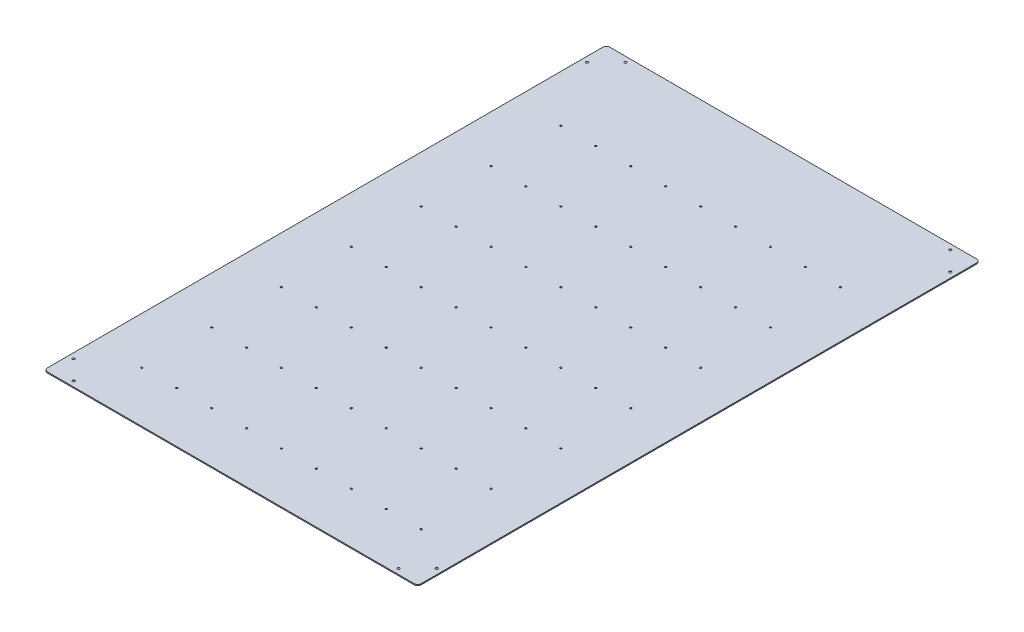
ISO-10303-21;
HEADER;
FILE_DESCRIPTION(('STEP AP214'),'2;1');
FILE_NAME('part.step','',(''),(''),'','','');
FILE_SCHEMA(('AUTOMOTIVE_DESIGN { 1 0 10303 214 1 1 1 1 }'));
ENDSEC;
DATA;
#1=APPLICATION_CONTEXT('core data for automotive mechanical design processes');
#2=APPLICATION_PROTOCOL_DEFINITION('international standard','automotive_design',2000,#1);
#3=PRODUCT_CONTEXT('',#1,'mechanical');
#4=PRODUCT('Part','Part','',(#3));
#5=PRODUCT_RELATED_PRODUCT_CATEGORY('part','',(#4));
#6=PRODUCT_DEFINITION_FORMATION('','',#4);
#7=PRODUCT_DEFINITION_CONTEXT('part definition',#1,'design');
#8=PRODUCT_DEFINITION('design','',#6,#7);
#9=PRODUCT_DEFINITION_SHAPE('','',#8);
#10=(LENGTH_UNIT() NAMED_UNIT(*) SI_UNIT(.MILLI.,.METRE.));
#11=(NAMED_UNIT(*) PLANE_ANGLE_UNIT() SI_UNIT($,.RADIAN.));
#12=(NAMED_UNIT(*) SI_UNIT($,.STERADIAN.) SOLID_ANGLE_UNIT());
#13=UNCERTAINTY_MEASURE_WITH_UNIT(LENGTH_MEASURE(1.E-05),#10,'distance_accuracy_value','');
#14=(GEOMETRIC_REPRESENTATION_CONTEXT(3) GLOBAL_UNCERTAINTY_ASSIGNED_CONTEXT((#13)) GLOBAL_UNIT_ASSIGNED_CONTEXT((#10,
#11,#12)) REPRESENTATION_CONTEXT('',''));
#15=CARTESIAN_POINT('',(0.,0.,0.));
#16=DIRECTION('',(0.,0.,1.));
#17=DIRECTION('',(1.,0.,0.));
#18=AXIS2_PLACEMENT_3D('',#15,#16,#17);
#19=CARTESIAN_POINT('',(400.,3.,-540.));
#20=DIRECTION('',(0.,1.,0.));
#21=DIRECTION('',(0.,0.,1.));
#22=AXIS2_PLACEMENT_3D('',#19,#20,#21);
#23=CYLINDRICAL_SURFACE('',#22,2.5);
#24=CARTESIAN_POINT('',(400.,0.,-540.));
#25=DIRECTION('',(0.,1.,0.));
#26=DIRECTION('',(0.,0.,1.));
#27=AXIS2_PLACEMENT_3D('',#24,#25,#26);
#28=CIRCLE('',#27,2.5);
#29=CARTESIAN_POINT('',(400.,0.,-537.5));
#30=VERTEX_POINT('',#29);
#31=EDGE_CURVE('E506',#30,#30,#28,.T.);
#32=ORIENTED_EDGE('',*,*,#31,.F.);
#33=EDGE_LOOP('',(#32));
#34=FACE_BOUND('',#33,.T.);
#35=CARTESIAN_POINT('',(400.,3.,-540.));
#36=DIRECTION('',(0.,1.,0.));
#37=DIRECTION('',(0.,0.,1.));
#38=AXIS2_PLACEMENT_3D('',#35,#36,#37);
#39=CIRCLE('',#38,2.5);
#40=CARTESIAN_POINT('',(400.,3.,-537.5));
#41=VERTEX_POINT('',#40);
#42=EDGE_CURVE('E509',#41,#41,#39,.T.);
#43=ORIENTED_EDGE('',*,*,#42,.T.);
#44=EDGE_LOOP('',(#43));
#45=FACE_BOUND('',#44,.T.);
#46=ADVANCED_FACE('F49',(#34,#45),#23,.F.);
#47=CARTESIAN_POINT('',(400.,3.,-340.));
#48=DIRECTION('',(0.,1.,0.));
#49=DIRECTION('',(0.,0.,1.));
#50=AXIS2_PLACEMENT_3D('',#47,#48,#49);
#51=CYLINDRICAL_SURFACE('',#50,2.5);
#52=CARTESIAN_POINT('',(400.,0.,-340.));
#53=DIRECTION('',(0.,1.,0.));
#54=DIRECTION('',(0.,0.,1.));
#55=AXIS2_PLACEMENT_3D('',#52,#53,#54);
#56=CIRCLE('',#55,2.5);
#57=CARTESIAN_POINT('',(400.,0.,-337.5));
#58=VERTEX_POINT('',#57);
#59=EDGE_CURVE('E500',#58,#58,#56,.T.);
#60=ORIENTED_EDGE('',*,*,#59,.F.);
#61=EDGE_LOOP('',(#60));
#62=FACE_BOUND('',#61,.T.);
#63=CARTESIAN_POINT('',(400.,3.,-340.));
#64=DIRECTION('',(0.,1.,0.));
#65=DIRECTION('',(0.,0.,1.));
#66=AXIS2_PLACEMENT_3D('',#63,#64,#65);
#67=CIRCLE('',#66,2.5);
#68=CARTESIAN_POINT('',(400.,3.,-337.5));
#69=VERTEX_POINT('',#68);
#70=EDGE_CURVE('E503',#69,#69,#67,.T.);
#71=ORIENTED_EDGE('',*,*,#70,.T.);
#72=EDGE_LOOP('',(#71));
#73=FACE_BOUND('',#72,.T.);
#74=ADVANCED_FACE('F714',(#62,#73),#51,.F.);
#75=CARTESIAN_POINT('',(400.,3.,-140.));
#76=DIRECTION('',(0.,1.,0.));
#77=DIRECTION('',(0.,0.,1.));
#78=AXIS2_PLACEMENT_3D('',#75,#76,#77);
#79=CYLINDRICAL_SURFACE('',#78,2.5);
#80=CARTESIAN_POINT('',(400.,0.,-140.));
#81=DIRECTION('',(0.,1.,0.));
#82=DIRECTION('',(0.,0.,1.));
#83=AXIS2_PLACEMENT_3D('',#80,#81,#82);
#84=CIRCLE('',#83,2.5);
#85=CARTESIAN_POINT('',(400.,0.,-137.5));
#86=VERTEX_POINT('',#85);
#87=EDGE_CURVE('E494',#86,#86,#84,.T.);
#88=ORIENTED_EDGE('',*,*,#87,.F.);
#89=EDGE_LOOP('',(#88));
#90=FACE_BOUND('',#89,.T.);
#91=CARTESIAN_POINT('',(400.,3.,-140.));
#92=DIRECTION('',(0.,1.,0.));
#93=DIRECTION('',(0.,0.,1.));
#94=AXIS2_PLACEMENT_3D('',#91,#92,#93);
#95=CIRCLE('',#94,2.5);
#96=CARTESIAN_POINT('',(400.,3.,-137.5));
#97=VERTEX_POINT('',#96);
#98=EDGE_CURVE('E497',#97,#97,#95,.T.);
#99=ORIENTED_EDGE('',*,*,#98,.T.);
#100=EDGE_LOOP('',(#99));
#101=FACE_BOUND('',#100,.T.);
#102=ADVANCED_FACE('F720',(#90,#101),#79,.F.);
#103=CARTESIAN_POINT('',(400.,3.,59.9999999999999));
#104=DIRECTION('',(0.,1.,0.));
#105=DIRECTION('',(0.,0.,1.));
#106=AXIS2_PLACEMENT_3D('',#103,#104,#105);
#107=CYLINDRICAL_SURFACE('',#106,2.5);
#108=CARTESIAN_POINT('',(400.,0.,59.9999999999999));
#109=DIRECTION('',(0.,1.,0.));
#110=DIRECTION('',(0.,0.,1.));
#111=AXIS2_PLACEMENT_3D('',#108,#109,#110);
#112=CIRCLE('',#111,2.5);
#113=CARTESIAN_POINT('',(400.,0.,62.4999999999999));
#114=VERTEX_POINT('',#113);
#115=EDGE_CURVE('E488',#114,#114,#112,.T.);
#116=ORIENTED_EDGE('',*,*,#115,.F.);
#117=EDGE_LOOP('',(#116));
#118=FACE_BOUND('',#117,.T.);
#119=CARTESIAN_POINT('',(400.,3.,59.9999999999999));
#120=DIRECTION('',(0.,1.,0.));
#121=DIRECTION('',(0.,0.,1.));
#122=AXIS2_PLACEMENT_3D('',#119,#120,#121);
#123=CIRCLE('',#122,2.5);
#124=CARTESIAN_POINT('',(400.,3.,62.4999999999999));
#125=VERTEX_POINT('',#124);
#126=EDGE_CURVE('E491',#125,#125,#123,.T.);
#127=ORIENTED_EDGE('',*,*,#126,.T.);
#128=EDGE_LOOP('',(#127));
#129=FACE_BOUND('',#128,.T.);
#130=ADVANCED_FACE('F971',(#118,#129),#107,.F.);
#131=CARTESIAN_POINT('',(400.,3.,260.));
#132=DIRECTION('',(0.,1.,0.));
#133=DIRECTION('',(0.,0.,1.));
#134=AXIS2_PLACEMENT_3D('',#131,#132,#133);
#135=CYLINDRICAL_SURFACE('',#134,2.5);
#136=CARTESIAN_POINT('',(400.,0.,260.));
#137=DIRECTION('',(0.,1.,0.));
#138=DIRECTION('',(0.,0.,1.));
#139=AXIS2_PLACEMENT_3D('',#136,#137,#138);
#140=CIRCLE('',#139,2.5);
#141=CARTESIAN_POINT('',(400.,0.,262.5));
#142=VERTEX_POINT('',#141);
#143=EDGE_CURVE('E482',#142,#142,#140,.T.);
#144=ORIENTED_EDGE('',*,*,#143,.F.);
#145=EDGE_LOOP('',(#144));
#146=FACE_BOUND('',#145,.T.);
#147=CARTESIAN_POINT('',(400.,3.,260.));
#148=DIRECTION('',(0.,1.,0.));
#149=DIRECTION('',(0.,0.,1.));
#150=AXIS2_PLACEMENT_3D('',#147,#148,#149);
#151=CIRCLE('',#150,2.5);
#152=CARTESIAN_POINT('',(400.,3.,262.5));
#153=VERTEX_POINT('',#152);
#154=EDGE_CURVE('E485',#153,#153,#151,.T.);
#155=ORIENTED_EDGE('',*,*,#154,.T.);
#156=EDGE_LOOP('',(#155));
#157=FACE_BOUND('',#156,.T.);
#158=ADVANCED_FACE('F967',(#146,#157),#135,.F.);
#159=CARTESIAN_POINT('',(400.,3.,460.));
#160=DIRECTION('',(0.,1.,0.));
#161=DIRECTION('',(0.,0.,1.));
#162=AXIS2_PLACEMENT_3D('',#159,#160,#161);
#163=CYLINDRICAL_SURFACE('',#162,2.5);
#164=CARTESIAN_POINT('',(400.,0.,460.));
#165=DIRECTION('',(0.,1.,0.));
#166=DIRECTION('',(0.,0.,1.));
#167=AXIS2_PLACEMENT_3D('',#164,#165,#166);
#168=CIRCLE('',#167,2.5);
#169=CARTESIAN_POINT('',(400.,0.,462.5));
#170=VERTEX_POINT('',#169);
#171=EDGE_CURVE('E476',#170,#170,#168,.T.);
#172=ORIENTED_EDGE('',*,*,#171,.F.);
#173=EDGE_LOOP('',(#172));
#174=FACE_BOUND('',#173,.T.);
#175=CARTESIAN_POINT('',(400.,3.,460.));
#176=DIRECTION('',(0.,1.,0.));
#177=DIRECTION('',(0.,0.,1.));
#178=AXIS2_PLACEMENT_3D('',#175,#176,#177);
#179=CIRCLE('',#178,2.5);
#180=CARTESIAN_POINT('',(400.,3.,462.5));
#181=VERTEX_POINT('',#180);
#182=EDGE_CURVE('E479',#181,#181,#179,.T.);
#183=ORIENTED_EDGE('',*,*,#182,.T.);
#184=EDGE_LOOP('',(#183));
#185=FACE_BOUND('',#184,.T.);
#186=ADVANCED_FACE('F963',(#174,#185),#163,.F.);
#187=CARTESIAN_POINT('',(400.,3.,660.));
#188=DIRECTION('',(0.,1.,0.));
#189=DIRECTION('',(0.,0.,1.));
#190=AXIS2_PLACEMENT_3D('',#187,#188,#189);
#191=CYLINDRICAL_SURFACE('',#190,2.5);
#192=CARTESIAN_POINT('',(400.,0.,660.));
#193=DIRECTION('',(0.,1.,0.));
#194=DIRECTION('',(0.,0.,1.));
#195=AXIS2_PLACEMENT_3D('',#192,#193,#194);
#196=CIRCLE('',#195,2.5);
#197=CARTESIAN_POINT('',(400.,0.,662.5));
#198=VERTEX_POINT('',#197);
#199=EDGE_CURVE('E470',#198,#198,#196,.T.);
#200=ORIENTED_EDGE('',*,*,#199,.F.);
#201=EDGE_LOOP('',(#200));
#202=FACE_BOUND('',#201,.T.);
#203=CARTESIAN_POINT('',(400.,3.,660.));
#204=DIRECTION('',(0.,1.,0.));
#205=DIRECTION('',(0.,0.,1.));
#206=AXIS2_PLACEMENT_3D('',#203,#204,#205);
#207=CIRCLE('',#206,2.5);
#208=CARTESIAN_POINT('',(400.,3.,662.5));
#209=VERTEX_POINT('',#208);
#210=EDGE_CURVE('E473',#209,#209,#207,.T.);
#211=ORIENTED_EDGE('',*,*,#210,.T.);
#212=EDGE_LOOP('',(#211));
#213=FACE_BOUND('',#212,.T.);
#214=ADVANCED_FACE('F959',(#202,#213),#191,.F.);
#215=CARTESIAN_POINT('',(300.,3.,-540.));
#216=DIRECTION('',(0.,1.,0.));
#217=DIRECTION('',(0.,0.,1.));
#218=AXIS2_PLACEMENT_3D('',#215,#216,#217);
#219=CYLINDRICAL_SURFACE('',#218,2.5);
#220=CARTESIAN_POINT('',(300.,0.,-540.));
#221=DIRECTION('',(0.,1.,0.));
#222=DIRECTION('',(0.,0.,1.));
#223=AXIS2_PLACEMENT_3D('',#220,#221,#222);
#224=CIRCLE('',#223,2.5);
#225=CARTESIAN_POINT('',(300.,0.,-537.5));
#226=VERTEX_POINT('',#225);
#227=EDGE_CURVE('E464',#226,#226,#224,.T.);
#228=ORIENTED_EDGE('',*,*,#227,.F.);
#229=EDGE_LOOP('',(#228));
#230=FACE_BOUND('',#229,.T.);
#231=CARTESIAN_POINT('',(300.,3.,-540.));
#232=DIRECTION('',(0.,1.,0.));
#233=DIRECTION('',(0.,0.,1.));
#234=AXIS2_PLACEMENT_3D('',#231,#232,#233);
#235=CIRCLE('',#234,2.5);
#236=CARTESIAN_POINT('',(300.,3.,-537.5));
#237=VERTEX_POINT('',#236);
#238=EDGE_CURVE('E467',#237,#237,#235,.T.);
#239=ORIENTED_EDGE('',*,*,#238,.T.);
#240=EDGE_LOOP('',(#239));
#241=FACE_BOUND('',#240,.T.);
#242=ADVANCED_FACE('F955',(#230,#241),#219,.F.);
#243=CARTESIAN_POINT('',(300.,3.,660.));
#244=DIRECTION('',(0.,1.,0.));
#245=DIRECTION('',(0.,0.,1.));
#246=AXIS2_PLACEMENT_3D('',#243,#244,#245);
#247=CYLINDRICAL_SURFACE('',#246,2.5);
#248=CARTESIAN_POINT('',(300.,0.,660.));
#249=DIRECTION('',(0.,1.,0.));
#250=DIRECTION('',(0.,0.,1.));
#251=AXIS2_PLACEMENT_3D('',#248,#249,#250);
#252=CIRCLE('',#251,2.5);
#253=CARTESIAN_POINT('',(300.,0.,662.5));
#254=VERTEX_POINT('',#253);
#255=EDGE_CURVE('E458',#254,#254,#252,.T.);
#256=ORIENTED_EDGE('',*,*,#255,.F.);
#257=EDGE_LOOP('',(#256));
#258=FACE_BOUND('',#257,.T.);
#259=CARTESIAN_POINT('',(300.,3.,660.));
#260=DIRECTION('',(0.,1.,0.));
#261=DIRECTION('',(0.,0.,1.));
#262=AXIS2_PLACEMENT_3D('',#259,#260,#261);
#263=CIRCLE('',#262,2.5);
#264=CARTESIAN_POINT('',(300.,3.,662.5));
#265=VERTEX_POINT('',#264);
#266=EDGE_CURVE('E461',#265,#265,#263,.T.);
#267=ORIENTED_EDGE('',*,*,#266,.T.);
#268=EDGE_LOOP('',(#267));
#269=FACE_BOUND('',#268,.T.);
#270=ADVANCED_FACE('F951',(#258,#269),#247,.F.);
#271=CARTESIAN_POINT('',(200.,3.,-540.));
#272=DIRECTION('',(0.,1.,0.));
#273=DIRECTION('',(0.,0.,1.));
#274=AXIS2_PLACEMENT_3D('',#271,#272,#273);
#275=CYLINDRICAL_SURFACE('',#274,2.5);
#276=CARTESIAN_POINT('',(200.,0.,-540.));
#277=DIRECTION('',(0.,1.,0.));
#278=DIRECTION('',(0.,0.,1.));
#279=AXIS2_PLACEMENT_3D('',#276,#277,#278);
#280=CIRCLE('',#279,2.5);
#281=CARTESIAN_POINT('',(200.,0.,-537.5));
#282=VERTEX_POINT('',#281);
#283=EDGE_CURVE('E452',#282,#282,#280,.T.);
#284=ORIENTED_EDGE('',*,*,#283,.F.);
#285=EDGE_LOOP('',(#284));
#286=FACE_BOUND('',#285,.T.);
#287=CARTESIAN_POINT('',(200.,3.,-540.));
#288=DIRECTION('',(0.,1.,0.));
#289=DIRECTION('',(0.,0.,1.));
#290=AXIS2_PLACEMENT_3D('',#287,#288,#289);
#291=CIRCLE('',#290,2.5);
#292=CARTESIAN_POINT('',(200.,3.,-537.5));
#293=VERTEX_POINT('',#292);
#294=EDGE_CURVE('E455',#293,#293,#291,.T.);
#295=ORIENTED_EDGE('',*,*,#294,.T.);
#296=EDGE_LOOP('',(#295));
#297=FACE_BOUND('',#296,.T.);
#298=ADVANCED_FACE('F947',(#286,#297),#275,.F.);
#299=CARTESIAN_POINT('',(200.,3.,660.));
#300=DIRECTION('',(0.,1.,0.));
#301=DIRECTION('',(0.,0.,1.));
#302=AXIS2_PLACEMENT_3D('',#299,#300,#301);
#303=CYLINDRICAL_SURFACE('',#302,2.5);
#304=CARTESIAN_POINT('',(200.,0.,660.));
#305=DIRECTION('',(0.,1.,0.));
#306=DIRECTION('',(0.,0.,1.));
#307=AXIS2_PLACEMENT_3D('',#304,#305,#306);
#308=CIRCLE('',#307,2.5);
#309=CARTESIAN_POINT('',(200.,0.,662.5));
#310=VERTEX_POINT('',#309);
#311=EDGE_CURVE('E446',#310,#310,#308,.T.);
#312=ORIENTED_EDGE('',*,*,#311,.F.);
#313=EDGE_LOOP('',(#312));
#314=FACE_BOUND('',#313,.T.);
#315=CARTESIAN_POINT('',(200.,3.,660.));
#316=DIRECTION('',(0.,1.,0.));
#317=DIRECTION('',(0.,0.,1.));
#318=AXIS2_PLACEMENT_3D('',#315,#316,#317);
#319=CIRCLE('',#318,2.5);
#320=CARTESIAN_POINT('',(200.,3.,662.5));
#321=VERTEX_POINT('',#320);
#322=EDGE_CURVE('E449',#321,#321,#319,.T.);
#323=ORIENTED_EDGE('',*,*,#322,.T.);
#324=EDGE_LOOP('',(#323));
#325=FACE_BOUND('',#324,.T.);
#326=ADVANCED_FACE('F943',(#314,#325),#303,.F.);
#327=CARTESIAN_POINT('',(99.9999999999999,3.,-540.));
#328=DIRECTION('',(0.,1.,0.));
#329=DIRECTION('',(0.,0.,1.));
#330=AXIS2_PLACEMENT_3D('',#327,#328,#329);
#331=CYLINDRICAL_SURFACE('',#330,2.5);
#332=CARTESIAN_POINT('',(99.9999999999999,0.,-540.));
#333=DIRECTION('',(0.,1.,0.));
#334=DIRECTION('',(0.,0.,1.));
#335=AXIS2_PLACEMENT_3D('',#332,#333,#334);
#336=CIRCLE('',#335,2.5);
#337=CARTESIAN_POINT('',(99.9999999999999,0.,-537.5));
#338=VERTEX_POINT('',#337);
#339=EDGE_CURVE('E440',#338,#338,#336,.T.);
#340=ORIENTED_EDGE('',*,*,#339,.F.);
#341=EDGE_LOOP('',(#340));
#342=FACE_BOUND('',#341,.T.);
#343=CARTESIAN_POINT('',(99.9999999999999,3.,-540.));
#344=DIRECTION('',(0.,1.,0.));
#345=DIRECTION('',(0.,0.,1.));
#346=AXIS2_PLACEMENT_3D('',#343,#344,#345);
#347=CIRCLE('',#346,2.5);
#348=CARTESIAN_POINT('',(99.9999999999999,3.,-537.5));
#349=VERTEX_POINT('',#348);
#350=EDGE_CURVE('E443',#349,#349,#347,.T.);
#351=ORIENTED_EDGE('',*,*,#350,.T.);
#352=EDGE_LOOP('',(#351));
#353=FACE_BOUND('',#352,.T.);
#354=ADVANCED_FACE('F939',(#342,#353),#331,.F.);
#355=CARTESIAN_POINT('',(100.,3.,660.));
#356=DIRECTION('',(0.,1.,0.));
#357=DIRECTION('',(0.,0.,1.));
#358=AXIS2_PLACEMENT_3D('',#355,#356,#357);
#359=CYLINDRICAL_SURFACE('',#358,2.5);
#360=CARTESIAN_POINT('',(100.,0.,660.));
#361=DIRECTION('',(0.,1.,0.));
#362=DIRECTION('',(0.,0.,1.));
#363=AXIS2_PLACEMENT_3D('',#360,#361,#362);
#364=CIRCLE('',#363,2.5);
#365=CARTESIAN_POINT('',(100.,0.,662.5));
#366=VERTEX_POINT('',#365);
#367=EDGE_CURVE('E434',#366,#366,#364,.T.);
#368=ORIENTED_EDGE('',*,*,#367,.F.);
#369=EDGE_LOOP('',(#368));
#370=FACE_BOUND('',#369,.T.);
#371=CARTESIAN_POINT('',(100.,3.,660.));
#372=DIRECTION('',(0.,1.,0.));
#373=DIRECTION('',(0.,0.,1.));
#374=AXIS2_PLACEMENT_3D('',#371,#372,#373);
#375=CIRCLE('',#374,2.5);
#376=CARTESIAN_POINT('',(100.,3.,662.5));
#377=VERTEX_POINT('',#376);
#378=EDGE_CURVE('E437',#377,#377,#375,.T.);
#379=ORIENTED_EDGE('',*,*,#378,.T.);
#380=EDGE_LOOP('',(#379));
#381=FACE_BOUND('',#380,.T.);
#382=ADVANCED_FACE('F935',(#370,#381),#359,.F.);
#383=CARTESIAN_POINT('',(0.,3.,-540.));
#384=DIRECTION('',(0.,1.,0.));
#385=DIRECTION('',(0.,0.,1.));
#386=AXIS2_PLACEMENT_3D('',#383,#384,#385);
#387=CYLINDRICAL_SURFACE('',#386,2.5);
#388=CARTESIAN_POINT('',(0.,0.,-540.));
#389=DIRECTION('',(0.,1.,0.));
#390=DIRECTION('',(0.,0.,1.));
#391=AXIS2_PLACEMENT_3D('',#388,#389,#390);
#392=CIRCLE('',#391,2.5);
#393=CARTESIAN_POINT('',(0.,0.,-537.5));
#394=VERTEX_POINT('',#393);
#395=EDGE_CURVE('E428',#394,#394,#392,.T.);
#396=ORIENTED_EDGE('',*,*,#395,.F.);
#397=EDGE_LOOP('',(#396));
#398=FACE_BOUND('',#397,.T.);
#399=CARTESIAN_POINT('',(0.,3.,-540.));
#400=DIRECTION('',(0.,1.,0.));
#401=DIRECTION('',(0.,0.,1.));
#402=AXIS2_PLACEMENT_3D('',#399,#400,#401);
#403=CIRCLE('',#402,2.5);
#404=CARTESIAN_POINT('',(0.,3.,-537.5));
#405=VERTEX_POINT('',#404);
#406=EDGE_CURVE('E431',#405,#405,#403,.T.);
#407=ORIENTED_EDGE('',*,*,#406,.T.);
#408=EDGE_LOOP('',(#407));
#409=FACE_BOUND('',#408,.T.);
#410=ADVANCED_FACE('F931',(#398,#409),#387,.F.);
#411=CARTESIAN_POINT('',(1.11022302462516E-13,3.,660.));
#412=DIRECTION('',(0.,1.,0.));
#413=DIRECTION('',(0.,0.,1.));
#414=AXIS2_PLACEMENT_3D('',#411,#412,#413);
#415=CYLINDRICAL_SURFACE('',#414,2.5);
#416=CARTESIAN_POINT('',(1.11022302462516E-13,0.,660.));
#417=DIRECTION('',(0.,1.,0.));
#418=DIRECTION('',(0.,0.,1.));
#419=AXIS2_PLACEMENT_3D('',#416,#417,#418);
#420=CIRCLE('',#419,2.5);
#421=CARTESIAN_POINT('',(1.11022302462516E-13,0.,662.5));
#422=VERTEX_POINT('',#421);
#423=EDGE_CURVE('E422',#422,#422,#420,.T.);
#424=ORIENTED_EDGE('',*,*,#423,.F.);
#425=EDGE_LOOP('',(#424));
#426=FACE_BOUND('',#425,.T.);
#427=CARTESIAN_POINT('',(1.11022302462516E-13,3.,660.));
#428=DIRECTION('',(0.,1.,0.));
#429=DIRECTION('',(0.,0.,1.));
#430=AXIS2_PLACEMENT_3D('',#427,#428,#429);
#431=CIRCLE('',#430,2.5);
#432=CARTESIAN_POINT('',(1.11022302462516E-13,3.,662.5));
#433=VERTEX_POINT('',#432);
#434=EDGE_CURVE('E425',#433,#433,#431,.T.);
#435=ORIENTED_EDGE('',*,*,#434,.T.);
#436=EDGE_LOOP('',(#435));
#437=FACE_BOUND('',#436,.T.);
#438=ADVANCED_FACE('F927',(#426,#437),#415,.F.);
#439=CARTESIAN_POINT('',(-100.,3.,-540.));
#440=DIRECTION('',(0.,1.,0.));
#441=DIRECTION('',(0.,0.,1.));
#442=AXIS2_PLACEMENT_3D('',#439,#440,#441);
#443=CYLINDRICAL_SURFACE('',#442,2.5);
#444=CARTESIAN_POINT('',(-100.,0.,-540.));
#445=DIRECTION('',(0.,1.,0.));
#446=DIRECTION('',(0.,0.,1.));
#447=AXIS2_PLACEMENT_3D('',#444,#445,#446);
#448=CIRCLE('',#447,2.5);
#449=CARTESIAN_POINT('',(-100.,0.,-537.5));
#450=VERTEX_POINT('',#449);
#451=EDGE_CURVE('E416',#450,#450,#448,.T.);
#452=ORIENTED_EDGE('',*,*,#451,.F.);
#453=EDGE_LOOP('',(#452));
#454=FACE_BOUND('',#453,.T.);
#455=CARTESIAN_POINT('',(-100.,3.,-540.));
#456=DIRECTION('',(0.,1.,0.));
#457=DIRECTION('',(0.,0.,1.));
#458=AXIS2_PLACEMENT_3D('',#455,#456,#457);
#459=CIRCLE('',#458,2.5);
#460=CARTESIAN_POINT('',(-100.,3.,-537.5));
#461=VERTEX_POINT('',#460);
#462=EDGE_CURVE('E419',#461,#461,#459,.T.);
#463=ORIENTED_EDGE('',*,*,#462,.T.);
#464=EDGE_LOOP('',(#463));
#465=FACE_BOUND('',#464,.T.);
#466=ADVANCED_FACE('F923',(#454,#465),#443,.F.);
#467=CARTESIAN_POINT('',(-99.9999999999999,3.,660.));
#468=DIRECTION('',(0.,1.,0.));
#469=DIRECTION('',(0.,0.,1.));
#470=AXIS2_PLACEMENT_3D('',#467,#468,#469);
#471=CYLINDRICAL_SURFACE('',#470,2.5);
#472=CARTESIAN_POINT('',(-99.9999999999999,0.,660.));
#473=DIRECTION('',(0.,1.,0.));
#474=DIRECTION('',(0.,0.,1.));
#475=AXIS2_PLACEMENT_3D('',#472,#473,#474);
#476=CIRCLE('',#475,2.5);
#477=CARTESIAN_POINT('',(-99.9999999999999,0.,662.5));
#478=VERTEX_POINT('',#477);
#479=EDGE_CURVE('E410',#478,#478,#476,.T.);
#480=ORIENTED_EDGE('',*,*,#479,.F.);
#481=EDGE_LOOP('',(#480));
#482=FACE_BOUND('',#481,.T.);
#483=CARTESIAN_POINT('',(-99.9999999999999,3.,660.));
#484=DIRECTION('',(0.,1.,0.));
#485=DIRECTION('',(0.,0.,1.));
#486=AXIS2_PLACEMENT_3D('',#483,#484,#485);
#487=CIRCLE('',#486,2.5);
#488=CARTESIAN_POINT('',(-99.9999999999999,3.,662.5));
#489=VERTEX_POINT('',#488);
#490=EDGE_CURVE('E413',#489,#489,#487,.T.);
#491=ORIENTED_EDGE('',*,*,#490,.T.);
#492=EDGE_LOOP('',(#491));
#493=FACE_BOUND('',#492,.T.);
#494=ADVANCED_FACE('F919',(#482,#493),#471,.F.);
#495=CARTESIAN_POINT('',(-200.,3.,-540.));
#496=DIRECTION('',(0.,1.,0.));
#497=DIRECTION('',(0.,0.,1.));
#498=AXIS2_PLACEMENT_3D('',#495,#496,#497);
#499=CYLINDRICAL_SURFACE('',#498,2.5);
#500=CARTESIAN_POINT('',(-200.,0.,-540.));
#501=DIRECTION('',(0.,1.,0.));
#502=DIRECTION('',(0.,0.,1.));
#503=AXIS2_PLACEMENT_3D('',#500,#501,#502);
#504=CIRCLE('',#503,2.5);
#505=CARTESIAN_POINT('',(-200.,0.,-537.5));
#506=VERTEX_POINT('',#505);
#507=EDGE_CURVE('E404',#506,#506,#504,.T.);
#508=ORIENTED_EDGE('',*,*,#507,.F.);
#509=EDGE_LOOP('',(#508));
#510=FACE_BOUND('',#509,.T.);
#511=CARTESIAN_POINT('',(-200.,3.,-540.));
#512=DIRECTION('',(0.,1.,0.));
#513=DIRECTION('',(0.,0.,1.));
#514=AXIS2_PLACEMENT_3D('',#511,#512,#513);
#515=CIRCLE('',#514,2.5);
#516=CARTESIAN_POINT('',(-200.,3.,-537.5));
#517=VERTEX_POINT('',#516);
#518=EDGE_CURVE('E407',#517,#517,#515,.T.);
#519=ORIENTED_EDGE('',*,*,#518,.T.);
#520=EDGE_LOOP('',(#519));
#521=FACE_BOUND('',#520,.T.);
#522=ADVANCED_FACE('F915',(#510,#521),#499,.F.);
#523=CARTESIAN_POINT('',(-200.,3.,660.));
#524=DIRECTION('',(0.,1.,0.));
#525=DIRECTION('',(0.,0.,1.));
#526=AXIS2_PLACEMENT_3D('',#523,#524,#525);
#527=CYLINDRICAL_SURFACE('',#526,2.5);
#528=CARTESIAN_POINT('',(-200.,0.,660.));
#529=DIRECTION('',(0.,1.,0.));
#530=DIRECTION('',(0.,0.,1.));
#531=AXIS2_PLACEMENT_3D('',#528,#529,#530);
#532=CIRCLE('',#531,2.5);
#533=CARTESIAN_POINT('',(-200.,0.,662.5));
#534=VERTEX_POINT('',#533);
#535=EDGE_CURVE('E398',#534,#534,#532,.T.);
#536=ORIENTED_EDGE('',*,*,#535,.F.);
#537=EDGE_LOOP('',(#536));
#538=FACE_BOUND('',#537,.T.);
#539=CARTESIAN_POINT('',(-200.,3.,660.));
#540=DIRECTION('',(0.,1.,0.));
#541=DIRECTION('',(0.,0.,1.));
#542=AXIS2_PLACEMENT_3D('',#539,#540,#541);
#543=CIRCLE('',#542,2.5);
#544=CARTESIAN_POINT('',(-200.,3.,662.5));
#545=VERTEX_POINT('',#544);
#546=EDGE_CURVE('E401',#545,#545,#543,.T.);
#547=ORIENTED_EDGE('',*,*,#546,.T.);
#548=EDGE_LOOP('',(#547));
#549=FACE_BOUND('',#548,.T.);
#550=ADVANCED_FACE('F911',(#538,#549),#527,.F.);
#551=CARTESIAN_POINT('',(-300.,3.,-540.));
#552=DIRECTION('',(0.,1.,0.));
#553=DIRECTION('',(0.,0.,1.));
#554=AXIS2_PLACEMENT_3D('',#551,#552,#553);
#555=CYLINDRICAL_SURFACE('',#554,2.5);
#556=CARTESIAN_POINT('',(-300.,0.,-540.));
#557=DIRECTION('',(0.,1.,0.));
#558=DIRECTION('',(0.,0.,1.));
#559=AXIS2_PLACEMENT_3D('',#556,#557,#558);
#560=CIRCLE('',#559,2.5);
#561=CARTESIAN_POINT('',(-300.,0.,-537.5));
#562=VERTEX_POINT('',#561);
#563=EDGE_CURVE('E392',#562,#562,#560,.T.);
#564=ORIENTED_EDGE('',*,*,#563,.F.);
#565=EDGE_LOOP('',(#564));
#566=FACE_BOUND('',#565,.T.);
#567=CARTESIAN_POINT('',(-300.,3.,-540.));
#568=DIRECTION('',(0.,1.,0.));
#569=DIRECTION('',(0.,0.,1.));
#570=AXIS2_PLACEMENT_3D('',#567,#568,#569);
#571=CIRCLE('',#570,2.5);
#572=CARTESIAN_POINT('',(-300.,3.,-537.5));
#573=VERTEX_POINT('',#572);
#574=EDGE_CURVE('E395',#573,#573,#571,.T.);
#575=ORIENTED_EDGE('',*,*,#574,.T.);
#576=EDGE_LOOP('',(#575));
#577=FACE_BOUND('',#576,.T.);
#578=ADVANCED_FACE('F907',(#566,#577),#555,.F.);
#579=CARTESIAN_POINT('',(-300.,3.,660.));
#580=DIRECTION('',(0.,1.,0.));
#581=DIRECTION('',(0.,0.,1.));
#582=AXIS2_PLACEMENT_3D('',#579,#580,#581);
#583=CYLINDRICAL_SURFACE('',#582,2.5);
#584=CARTESIAN_POINT('',(-300.,0.,660.));
#585=DIRECTION('',(0.,1.,0.));
#586=DIRECTION('',(0.,0.,1.));
#587=AXIS2_PLACEMENT_3D('',#584,#585,#586);
#588=CIRCLE('',#587,2.5);
#589=CARTESIAN_POINT('',(-300.,0.,662.5));
#590=VERTEX_POINT('',#589);
#591=EDGE_CURVE('E386',#590,#590,#588,.T.);
#592=ORIENTED_EDGE('',*,*,#591,.F.);
#593=EDGE_LOOP('',(#592));
#594=FACE_BOUND('',#593,.T.);
#595=CARTESIAN_POINT('',(-300.,3.,660.));
#596=DIRECTION('',(0.,1.,0.));
#597=DIRECTION('',(0.,0.,1.));
#598=AXIS2_PLACEMENT_3D('',#595,#596,#597);
#599=CIRCLE('',#598,2.5);
#600=CARTESIAN_POINT('',(-300.,3.,662.5));
#601=VERTEX_POINT('',#600);
#602=EDGE_CURVE('E389',#601,#601,#599,.T.);
#603=ORIENTED_EDGE('',*,*,#602,.T.);
#604=EDGE_LOOP('',(#603));
#605=FACE_BOUND('',#604,.T.);
#606=ADVANCED_FACE('F903',(#594,#605),#583,.F.);
#607=CARTESIAN_POINT('',(-400.,3.,-540.));
#608=DIRECTION('',(0.,1.,0.));
#609=DIRECTION('',(0.,0.,1.));
#610=AXIS2_PLACEMENT_3D('',#607,#608,#609);
#611=CYLINDRICAL_SURFACE('',#610,2.5);
#612=CARTESIAN_POINT('',(-400.,0.,-540.));
#613=DIRECTION('',(0.,1.,0.));
#614=DIRECTION('',(0.,0.,1.));
#615=AXIS2_PLACEMENT_3D('',#612,#613,#614);
#616=CIRCLE('',#615,2.5);
#617=CARTESIAN_POINT('',(-400.,0.,-537.5));
#618=VERTEX_POINT('',#617);
#619=EDGE_CURVE('E380',#618,#618,#616,.T.);
#620=ORIENTED_EDGE('',*,*,#619,.F.);
#621=EDGE_LOOP('',(#620));
#622=FACE_BOUND('',#621,.T.);
#623=CARTESIAN_POINT('',(-400.,3.,-540.));
#624=DIRECTION('',(0.,1.,0.));
#625=DIRECTION('',(0.,0.,1.));
#626=AXIS2_PLACEMENT_3D('',#623,#624,#625);
#627=CIRCLE('',#626,2.5);
#628=CARTESIAN_POINT('',(-400.,3.,-537.5));
#629=VERTEX_POINT('',#628);
#630=EDGE_CURVE('E383',#629,#629,#627,.T.);
#631=ORIENTED_EDGE('',*,*,#630,.T.);
#632=EDGE_LOOP('',(#631));
#633=FACE_BOUND('',#632,.T.);
#634=ADVANCED_FACE('F899',(#622,#633),#611,.F.);
#635=CARTESIAN_POINT('',(-400.,3.,-340.));
#636=DIRECTION('',(0.,1.,0.));
#637=DIRECTION('',(0.,0.,1.));
#638=AXIS2_PLACEMENT_3D('',#635,#636,#637);
#639=CYLINDRICAL_SURFACE('',#638,2.5);
#640=CARTESIAN_POINT('',(-400.,0.,-340.));
#641=DIRECTION('',(0.,1.,0.));
#642=DIRECTION('',(0.,0.,1.));
#643=AXIS2_PLACEMENT_3D('',#640,#641,#642);
#644=CIRCLE('',#643,2.5);
#645=CARTESIAN_POINT('',(-400.,0.,-337.5));
#646=VERTEX_POINT('',#645);
#647=EDGE_CURVE('E374',#646,#646,#644,.T.);
#648=ORIENTED_EDGE('',*,*,#647,.F.);
#649=EDGE_LOOP('',(#648));
#650=FACE_BOUND('',#649,.T.);
#651=CARTESIAN_POINT('',(-400.,3.,-340.));
#652=DIRECTION('',(0.,1.,0.));
#653=DIRECTION('',(0.,0.,1.));
#654=AXIS2_PLACEMENT_3D('',#651,#652,#653);
#655=CIRCLE('',#654,2.5);
#656=CARTESIAN_POINT('',(-400.,3.,-337.5));
#657=VERTEX_POINT('',#656);
#658=EDGE_CURVE('E377',#657,#657,#655,.T.);
#659=ORIENTED_EDGE('',*,*,#658,.T.);
#660=EDGE_LOOP('',(#659));
#661=FACE_BOUND('',#660,.T.);
#662=ADVANCED_FACE('F895',(#650,#661),#639,.F.);
#663=CARTESIAN_POINT('',(-400.,3.,-140.));
#664=DIRECTION('',(0.,1.,0.));
#665=DIRECTION('',(0.,0.,1.));
#666=AXIS2_PLACEMENT_3D('',#663,#664,#665);
#667=CYLINDRICAL_SURFACE('',#666,2.5);
#668=CARTESIAN_POINT('',(-400.,0.,-140.));
#669=DIRECTION('',(0.,1.,0.));
#670=DIRECTION('',(0.,0.,1.));
#671=AXIS2_PLACEMENT_3D('',#668,#669,#670);
#672=CIRCLE('',#671,2.5);
#673=CARTESIAN_POINT('',(-400.,0.,-137.5));
#674=VERTEX_POINT('',#673);
#675=EDGE_CURVE('E368',#674,#674,#672,.T.);
#676=ORIENTED_EDGE('',*,*,#675,.F.);
#677=EDGE_LOOP('',(#676));
#678=FACE_BOUND('',#677,.T.);
#679=CARTESIAN_POINT('',(-400.,3.,-140.));
#680=DIRECTION('',(0.,1.,0.));
#681=DIRECTION('',(0.,0.,1.));
#682=AXIS2_PLACEMENT_3D('',#679,#680,#681);
#683=CIRCLE('',#682,2.5);
#684=CARTESIAN_POINT('',(-400.,3.,-137.5));
#685=VERTEX_POINT('',#684);
#686=EDGE_CURVE('E371',#685,#685,#683,.T.);
#687=ORIENTED_EDGE('',*,*,#686,.T.);
#688=EDGE_LOOP('',(#687));
#689=FACE_BOUND('',#688,.T.);
#690=ADVANCED_FACE('F891',(#678,#689),#667,.F.);
#691=CARTESIAN_POINT('',(-400.,3.,59.9999999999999));
#692=DIRECTION('',(0.,1.,0.));
#693=DIRECTION('',(0.,0.,1.));
#694=AXIS2_PLACEMENT_3D('',#691,#692,#693);
#695=CYLINDRICAL_SURFACE('',#694,2.5);
#696=CARTESIAN_POINT('',(-400.,0.,59.9999999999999));
#697=DIRECTION('',(0.,1.,0.));
#698=DIRECTION('',(0.,0.,1.));
#699=AXIS2_PLACEMENT_3D('',#696,#697,#698);
#700=CIRCLE('',#699,2.5);
#701=CARTESIAN_POINT('',(-400.,0.,62.4999999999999));
#702=VERTEX_POINT('',#701);
#703=EDGE_CURVE('E362',#702,#702,#700,.T.);
#704=ORIENTED_EDGE('',*,*,#703,.F.);
#705=EDGE_LOOP('',(#704));
#706=FACE_BOUND('',#705,.T.);
#707=CARTESIAN_POINT('',(-400.,3.,59.9999999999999));
#708=DIRECTION('',(0.,1.,0.));
#709=DIRECTION('',(0.,0.,1.));
#710=AXIS2_PLACEMENT_3D('',#707,#708,#709);
#711=CIRCLE('',#710,2.5);
#712=CARTESIAN_POINT('',(-400.,3.,62.4999999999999));
#713=VERTEX_POINT('',#712);
#714=EDGE_CURVE('E365',#713,#713,#711,.T.);
#715=ORIENTED_EDGE('',*,*,#714,.T.);
#716=EDGE_LOOP('',(#715));
#717=FACE_BOUND('',#716,.T.);
#718=ADVANCED_FACE('F887',(#706,#717),#695,.F.);
#719=CARTESIAN_POINT('',(-400.,3.,260.));
#720=DIRECTION('',(0.,1.,0.));
#721=DIRECTION('',(0.,0.,1.));
#722=AXIS2_PLACEMENT_3D('',#719,#720,#721);
#723=CYLINDRICAL_SURFACE('',#722,2.5);
#724=CARTESIAN_POINT('',(-400.,0.,260.));
#725=DIRECTION('',(0.,1.,0.));
#726=DIRECTION('',(0.,0.,1.));
#727=AXIS2_PLACEMENT_3D('',#724,#725,#726);
#728=CIRCLE('',#727,2.5);
#729=CARTESIAN_POINT('',(-400.,0.,262.5));
#730=VERTEX_POINT('',#729);
#731=EDGE_CURVE('E356',#730,#730,#728,.T.);
#732=ORIENTED_EDGE('',*,*,#731,.F.);
#733=EDGE_LOOP('',(#732));
#734=FACE_BOUND('',#733,.T.);
#735=CARTESIAN_POINT('',(-400.,3.,260.));
#736=DIRECTION('',(0.,1.,0.));
#737=DIRECTION('',(0.,0.,1.));
#738=AXIS2_PLACEMENT_3D('',#735,#736,#737);
#739=CIRCLE('',#738,2.5);
#740=CARTESIAN_POINT('',(-400.,3.,262.5));
#741=VERTEX_POINT('',#740);
#742=EDGE_CURVE('E359',#741,#741,#739,.T.);
#743=ORIENTED_EDGE('',*,*,#742,.T.);
#744=EDGE_LOOP('',(#743));
#745=FACE_BOUND('',#744,.T.);
#746=ADVANCED_FACE('F883',(#734,#745),#723,.F.);
#747=CARTESIAN_POINT('',(300.,3.,-340.));
#748=DIRECTION('',(0.,1.,0.));
#749=DIRECTION('',(0.,0.,1.));
#750=AXIS2_PLACEMENT_3D('',#747,#748,#749);
#751=CYLINDRICAL_SURFACE('',#750,2.5);
#752=CARTESIAN_POINT('',(300.,0.,-340.));
#753=DIRECTION('',(0.,1.,0.));
#754=DIRECTION('',(0.,0.,1.));
#755=AXIS2_PLACEMENT_3D('',#752,#753,#754);
#756=CIRCLE('',#755,2.5);
#757=CARTESIAN_POINT('',(300.,0.,-337.5));
#758=VERTEX_POINT('',#757);
#759=EDGE_CURVE('E350',#758,#758,#756,.T.);
#760=ORIENTED_EDGE('',*,*,#759,.F.);
#761=EDGE_LOOP('',(#760));
#762=FACE_BOUND('',#761,.T.);
#763=CARTESIAN_POINT('',(300.,3.,-340.));
#764=DIRECTION('',(0.,1.,0.));
#765=DIRECTION('',(0.,0.,1.));
#766=AXIS2_PLACEMENT_3D('',#763,#764,#765);
#767=CIRCLE('',#766,2.5);
#768=CARTESIAN_POINT('',(300.,3.,-337.5));
#769=VERTEX_POINT('',#768);
#770=EDGE_CURVE('E353',#769,#769,#767,.T.);
#771=ORIENTED_EDGE('',*,*,#770,.T.);
#772=EDGE_LOOP('',(#771));
#773=FACE_BOUND('',#772,.T.);
#774=ADVANCED_FACE('F879',(#762,#773),#751,.F.);
#775=CARTESIAN_POINT('',(300.,3.,-140.));
#776=DIRECTION('',(0.,1.,0.));
#777=DIRECTION('',(0.,0.,1.));
#778=AXIS2_PLACEMENT_3D('',#775,#776,#777);
#779=CYLINDRICAL_SURFACE('',#778,2.5);
#780=CARTESIAN_POINT('',(300.,0.,-140.));
#781=DIRECTION('',(0.,1.,0.));
#782=DIRECTION('',(0.,0.,1.));
#783=AXIS2_PLACEMENT_3D('',#780,#781,#782);
#784=CIRCLE('',#783,2.5);
#785=CARTESIAN_POINT('',(300.,0.,-137.5));
#786=VERTEX_POINT('',#785);
#787=EDGE_CURVE('E344',#786,#786,#784,.T.);
#788=ORIENTED_EDGE('',*,*,#787,.F.);
#789=EDGE_LOOP('',(#788));
#790=FACE_BOUND('',#789,.T.);
#791=CARTESIAN_POINT('',(300.,3.,-140.));
#792=DIRECTION('',(0.,1.,0.));
#793=DIRECTION('',(0.,0.,1.));
#794=AXIS2_PLACEMENT_3D('',#791,#792,#793);
#795=CIRCLE('',#794,2.5);
#796=CARTESIAN_POINT('',(300.,3.,-137.5));
#797=VERTEX_POINT('',#796);
#798=EDGE_CURVE('E347',#797,#797,#795,.T.);
#799=ORIENTED_EDGE('',*,*,#798,.T.);
#800=EDGE_LOOP('',(#799));
#801=FACE_BOUND('',#800,.T.);
#802=ADVANCED_FACE('F875',(#790,#801),#779,.F.);
#803=CARTESIAN_POINT('',(300.,3.,59.9999999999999));
#804=DIRECTION('',(0.,1.,0.));
#805=DIRECTION('',(0.,0.,1.));
#806=AXIS2_PLACEMENT_3D('',#803,#804,#805);
#807=CYLINDRICAL_SURFACE('',#806,2.5);
#808=CARTESIAN_POINT('',(300.,0.,59.9999999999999));
#809=DIRECTION('',(0.,1.,0.));
#810=DIRECTION('',(0.,0.,1.));
#811=AXIS2_PLACEMENT_3D('',#808,#809,#810);
#812=CIRCLE('',#811,2.5);
#813=CARTESIAN_POINT('',(300.,0.,62.4999999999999));
#814=VERTEX_POINT('',#813);
#815=EDGE_CURVE('E338',#814,#814,#812,.T.);
#816=ORIENTED_EDGE('',*,*,#815,.F.);
#817=EDGE_LOOP('',(#816));
#818=FACE_BOUND('',#817,.T.);
#819=CARTESIAN_POINT('',(300.,3.,59.9999999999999));
#820=DIRECTION('',(0.,1.,0.));
#821=DIRECTION('',(0.,0.,1.));
#822=AXIS2_PLACEMENT_3D('',#819,#820,#821);
#823=CIRCLE('',#822,2.5);
#824=CARTESIAN_POINT('',(300.,3.,62.4999999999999));
#825=VERTEX_POINT('',#824);
#826=EDGE_CURVE('E341',#825,#825,#823,.T.);
#827=ORIENTED_EDGE('',*,*,#826,.T.);
#828=EDGE_LOOP('',(#827));
#829=FACE_BOUND('',#828,.T.);
#830=ADVANCED_FACE('F871',(#818,#829),#807,.F.);
#831=CARTESIAN_POINT('',(300.,3.,260.));
#832=DIRECTION('',(0.,1.,0.));
#833=DIRECTION('',(0.,0.,1.));
#834=AXIS2_PLACEMENT_3D('',#831,#832,#833);
#835=CYLINDRICAL_SURFACE('',#834,2.5);
#836=CARTESIAN_POINT('',(300.,0.,260.));
#837=DIRECTION('',(0.,1.,0.));
#838=DIRECTION('',(0.,0.,1.));
#839=AXIS2_PLACEMENT_3D('',#836,#837,#838);
#840=CIRCLE('',#839,2.5);
#841=CARTESIAN_POINT('',(300.,0.,262.5));
#842=VERTEX_POINT('',#841);
#843=EDGE_CURVE('E332',#842,#842,#840,.T.);
#844=ORIENTED_EDGE('',*,*,#843,.F.);
#845=EDGE_LOOP('',(#844));
#846=FACE_BOUND('',#845,.T.);
#847=CARTESIAN_POINT('',(300.,3.,260.));
#848=DIRECTION('',(0.,1.,0.));
#849=DIRECTION('',(0.,0.,1.));
#850=AXIS2_PLACEMENT_3D('',#847,#848,#849);
#851=CIRCLE('',#850,2.5);
#852=CARTESIAN_POINT('',(300.,3.,262.5));
#853=VERTEX_POINT('',#852);
#854=EDGE_CURVE('E335',#853,#853,#851,.T.);
#855=ORIENTED_EDGE('',*,*,#854,.T.);
#856=EDGE_LOOP('',(#855));
#857=FACE_BOUND('',#856,.T.);
#858=ADVANCED_FACE('F867',(#846,#857),#835,.F.);
#859=CARTESIAN_POINT('',(300.,3.,460.));
#860=DIRECTION('',(0.,1.,0.));
#861=DIRECTION('',(0.,0.,1.));
#862=AXIS2_PLACEMENT_3D('',#859,#860,#861);
#863=CYLINDRICAL_SURFACE('',#862,2.5);
#864=CARTESIAN_POINT('',(300.,0.,460.));
#865=DIRECTION('',(0.,1.,0.));
#866=DIRECTION('',(0.,0.,1.));
#867=AXIS2_PLACEMENT_3D('',#864,#865,#866);
#868=CIRCLE('',#867,2.5);
#869=CARTESIAN_POINT('',(300.,0.,462.5));
#870=VERTEX_POINT('',#869);
#871=EDGE_CURVE('E326',#870,#870,#868,.T.);
#872=ORIENTED_EDGE('',*,*,#871,.F.);
#873=EDGE_LOOP('',(#872));
#874=FACE_BOUND('',#873,.T.);
#875=CARTESIAN_POINT('',(300.,3.,460.));
#876=DIRECTION('',(0.,1.,0.));
#877=DIRECTION('',(0.,0.,1.));
#878=AXIS2_PLACEMENT_3D('',#875,#876,#877);
#879=CIRCLE('',#878,2.5);
#880=CARTESIAN_POINT('',(300.,3.,462.5));
#881=VERTEX_POINT('',#880);
#882=EDGE_CURVE('E329',#881,#881,#879,.T.);
#883=ORIENTED_EDGE('',*,*,#882,.T.);
#884=EDGE_LOOP('',(#883));
#885=FACE_BOUND('',#884,.T.);
#886=ADVANCED_FACE('F863',(#874,#885),#863,.F.);
#887=CARTESIAN_POINT('',(200.,3.,-340.));
#888=DIRECTION('',(0.,1.,0.));
#889=DIRECTION('',(0.,0.,1.));
#890=AXIS2_PLACEMENT_3D('',#887,#888,#889);
#891=CYLINDRICAL_SURFACE('',#890,2.5);
#892=CARTESIAN_POINT('',(200.,0.,-340.));
#893=DIRECTION('',(0.,1.,0.));
#894=DIRECTION('',(0.,0.,1.));
#895=AXIS2_PLACEMENT_3D('',#892,#893,#894);
#896=CIRCLE('',#895,2.5);
#897=CARTESIAN_POINT('',(200.,0.,-337.5));
#898=VERTEX_POINT('',#897);
#899=EDGE_CURVE('E320',#898,#898,#896,.T.);
#900=ORIENTED_EDGE('',*,*,#899,.F.);
#901=EDGE_LOOP('',(#900));
#902=FACE_BOUND('',#901,.T.);
#903=CARTESIAN_POINT('',(200.,3.,-340.));
#904=DIRECTION('',(0.,1.,0.));
#905=DIRECTION('',(0.,0.,1.));
#906=AXIS2_PLACEMENT_3D('',#903,#904,#905);
#907=CIRCLE('',#906,2.5);
#908=CARTESIAN_POINT('',(200.,3.,-337.5));
#909=VERTEX_POINT('',#908);
#910=EDGE_CURVE('E323',#909,#909,#907,.T.);
#911=ORIENTED_EDGE('',*,*,#910,.T.);
#912=EDGE_LOOP('',(#911));
#913=FACE_BOUND('',#912,.T.);
#914=ADVANCED_FACE('F859',(#902,#913),#891,.F.);
#915=CARTESIAN_POINT('',(200.,3.,-140.));
#916=DIRECTION('',(0.,1.,0.));
#917=DIRECTION('',(0.,0.,1.));
#918=AXIS2_PLACEMENT_3D('',#915,#916,#917);
#919=CYLINDRICAL_SURFACE('',#918,2.5);
#920=CARTESIAN_POINT('',(200.,0.,-140.));
#921=DIRECTION('',(0.,1.,0.));
#922=DIRECTION('',(0.,0.,1.));
#923=AXIS2_PLACEMENT_3D('',#920,#921,#922);
#924=CIRCLE('',#923,2.5);
#925=CARTESIAN_POINT('',(200.,0.,-137.5));
#926=VERTEX_POINT('',#925);
#927=EDGE_CURVE('E314',#926,#926,#924,.T.);
#928=ORIENTED_EDGE('',*,*,#927,.F.);
#929=EDGE_LOOP('',(#928));
#930=FACE_BOUND('',#929,.T.);
#931=CARTESIAN_POINT('',(200.,3.,-140.));
#932=DIRECTION('',(0.,1.,0.));
#933=DIRECTION('',(0.,0.,1.));
#934=AXIS2_PLACEMENT_3D('',#931,#932,#933);
#935=CIRCLE('',#934,2.5);
#936=CARTESIAN_POINT('',(200.,3.,-137.5));
#937=VERTEX_POINT('',#936);
#938=EDGE_CURVE('E317',#937,#937,#935,.T.);
#939=ORIENTED_EDGE('',*,*,#938,.T.);
#940=EDGE_LOOP('',(#939));
#941=FACE_BOUND('',#940,.T.);
#942=ADVANCED_FACE('F855',(#930,#941),#919,.F.);
#943=CARTESIAN_POINT('',(200.,3.,59.9999999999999));
#944=DIRECTION('',(0.,1.,0.));
#945=DIRECTION('',(0.,0.,1.));
#946=AXIS2_PLACEMENT_3D('',#943,#944,#945);
#947=CYLINDRICAL_SURFACE('',#946,2.5);
#948=CARTESIAN_POINT('',(200.,0.,59.9999999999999));
#949=DIRECTION('',(0.,1.,0.));
#950=DIRECTION('',(0.,0.,1.));
#951=AXIS2_PLACEMENT_3D('',#948,#949,#950);
#952=CIRCLE('',#951,2.5);
#953=CARTESIAN_POINT('',(200.,0.,62.4999999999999));
#954=VERTEX_POINT('',#953);
#955=EDGE_CURVE('E308',#954,#954,#952,.T.);
#956=ORIENTED_EDGE('',*,*,#955,.F.);
#957=EDGE_LOOP('',(#956));
#958=FACE_BOUND('',#957,.T.);
#959=CARTESIAN_POINT('',(200.,3.,59.9999999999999));
#960=DIRECTION('',(0.,1.,0.));
#961=DIRECTION('',(0.,0.,1.));
#962=AXIS2_PLACEMENT_3D('',#959,#960,#961);
#963=CIRCLE('',#962,2.5);
#964=CARTESIAN_POINT('',(200.,3.,62.4999999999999));
#965=VERTEX_POINT('',#964);
#966=EDGE_CURVE('E311',#965,#965,#963,.T.);
#967=ORIENTED_EDGE('',*,*,#966,.T.);
#968=EDGE_LOOP('',(#967));
#969=FACE_BOUND('',#968,.T.);
#970=ADVANCED_FACE('F851',(#958,#969),#947,.F.);
#971=CARTESIAN_POINT('',(200.,3.,260.));
#972=DIRECTION('',(0.,1.,0.));
#973=DIRECTION('',(0.,0.,1.));
#974=AXIS2_PLACEMENT_3D('',#971,#972,#973);
#975=CYLINDRICAL_SURFACE('',#974,2.5);
#976=CARTESIAN_POINT('',(200.,0.,260.));
#977=DIRECTION('',(0.,1.,0.));
#978=DIRECTION('',(0.,0.,1.));
#979=AXIS2_PLACEMENT_3D('',#976,#977,#978);
#980=CIRCLE('',#979,2.5);
#981=CARTESIAN_POINT('',(200.,0.,262.5));
#982=VERTEX_POINT('',#981);
#983=EDGE_CURVE('E302',#982,#982,#980,.T.);
#984=ORIENTED_EDGE('',*,*,#983,.F.);
#985=EDGE_LOOP('',(#984));
#986=FACE_BOUND('',#985,.T.);
#987=CARTESIAN_POINT('',(200.,3.,260.));
#988=DIRECTION('',(0.,1.,0.));
#989=DIRECTION('',(0.,0.,1.));
#990=AXIS2_PLACEMENT_3D('',#987,#988,#989);
#991=CIRCLE('',#990,2.5);
#992=CARTESIAN_POINT('',(200.,3.,262.5));
#993=VERTEX_POINT('',#992);
#994=EDGE_CURVE('E305',#993,#993,#991,.T.);
#995=ORIENTED_EDGE('',*,*,#994,.T.);
#996=EDGE_LOOP('',(#995));
#997=FACE_BOUND('',#996,.T.);
#998=ADVANCED_FACE('F847',(#986,#997),#975,.F.);
#999=CARTESIAN_POINT('',(200.,3.,460.));
#1000=DIRECTION('',(0.,1.,0.));
#1001=DIRECTION('',(0.,0.,1.));
#1002=AXIS2_PLACEMENT_3D('',#999,#1000,#1001);
#1003=CYLINDRICAL_SURFACE('',#1002,2.5);
#1004=CARTESIAN_POINT('',(200.,0.,460.));
#1005=DIRECTION('',(0.,1.,0.));
#1006=DIRECTION('',(0.,0.,1.));
#1007=AXIS2_PLACEMENT_3D('',#1004,#1005,#1006);
#1008=CIRCLE('',#1007,2.5);
#1009=CARTESIAN_POINT('',(200.,0.,462.5));
#1010=VERTEX_POINT('',#1009);
#1011=EDGE_CURVE('E296',#1010,#1010,#1008,.T.);
#1012=ORIENTED_EDGE('',*,*,#1011,.F.);
#1013=EDGE_LOOP('',(#1012));
#1014=FACE_BOUND('',#1013,.T.);
#1015=CARTESIAN_POINT('',(200.,3.,460.));
#1016=DIRECTION('',(0.,1.,0.));
#1017=DIRECTION('',(0.,0.,1.));
#1018=AXIS2_PLACEMENT_3D('',#1015,#1016,#1017);
#1019=CIRCLE('',#1018,2.5);
#1020=CARTESIAN_POINT('',(200.,3.,462.5));
#1021=VERTEX_POINT('',#1020);
#1022=EDGE_CURVE('E299',#1021,#1021,#1019,.T.);
#1023=ORIENTED_EDGE('',*,*,#1022,.T.);
#1024=EDGE_LOOP('',(#1023));
#1025=FACE_BOUND('',#1024,.T.);
#1026=ADVANCED_FACE('F843',(#1014,#1025),#1003,.F.);
#1027=CARTESIAN_POINT('',(100.,3.,-340.));
#1028=DIRECTION('',(0.,1.,0.));
#1029=DIRECTION('',(0.,0.,1.));
#1030=AXIS2_PLACEMENT_3D('',#1027,#1028,#1029);
#1031=CYLINDRICAL_SURFACE('',#1030,2.5);
#1032=CARTESIAN_POINT('',(100.,0.,-340.));
#1033=DIRECTION('',(0.,1.,0.));
#1034=DIRECTION('',(0.,0.,1.));
#1035=AXIS2_PLACEMENT_3D('',#1032,#1033,#1034);
#1036=CIRCLE('',#1035,2.5);
#1037=CARTESIAN_POINT('',(100.,0.,-337.5));
#1038=VERTEX_POINT('',#1037);
#1039=EDGE_CURVE('E290',#1038,#1038,#1036,.T.);
#1040=ORIENTED_EDGE('',*,*,#1039,.F.);
#1041=EDGE_LOOP('',(#1040));
#1042=FACE_BOUND('',#1041,.T.);
#1043=CARTESIAN_POINT('',(100.,3.,-340.));
#1044=DIRECTION('',(0.,1.,0.));
#1045=DIRECTION('',(0.,0.,1.));
#1046=AXIS2_PLACEMENT_3D('',#1043,#1044,#1045);
#1047=CIRCLE('',#1046,2.5);
#1048=CARTESIAN_POINT('',(100.,3.,-337.5));
#1049=VERTEX_POINT('',#1048);
#1050=EDGE_CURVE('E293',#1049,#1049,#1047,.T.);
#1051=ORIENTED_EDGE('',*,*,#1050,.T.);
#1052=EDGE_LOOP('',(#1051));
#1053=FACE_BOUND('',#1052,.T.);
#1054=ADVANCED_FACE('F839',(#1042,#1053),#1031,.F.);
#1055=CARTESIAN_POINT('',(100.,3.,-140.));
#1056=DIRECTION('',(0.,1.,0.));
#1057=DIRECTION('',(0.,0.,1.));
#1058=AXIS2_PLACEMENT_3D('',#1055,#1056,#1057);
#1059=CYLINDRICAL_SURFACE('',#1058,2.5);
#1060=CARTESIAN_POINT('',(100.,0.,-140.));
#1061=DIRECTION('',(0.,1.,0.));
#1062=DIRECTION('',(0.,0.,1.));
#1063=AXIS2_PLACEMENT_3D('',#1060,#1061,#1062);
#1064=CIRCLE('',#1063,2.5);
#1065=CARTESIAN_POINT('',(100.,0.,-137.5));
#1066=VERTEX_POINT('',#1065);
#1067=EDGE_CURVE('E284',#1066,#1066,#1064,.T.);
#1068=ORIENTED_EDGE('',*,*,#1067,.F.);
#1069=EDGE_LOOP('',(#1068));
#1070=FACE_BOUND('',#1069,.T.);
#1071=CARTESIAN_POINT('',(100.,3.,-140.));
#1072=DIRECTION('',(0.,1.,0.));
#1073=DIRECTION('',(0.,0.,1.));
#1074=AXIS2_PLACEMENT_3D('',#1071,#1072,#1073);
#1075=CIRCLE('',#1074,2.5);
#1076=CARTESIAN_POINT('',(100.,3.,-137.5));
#1077=VERTEX_POINT('',#1076);
#1078=EDGE_CURVE('E287',#1077,#1077,#1075,.T.);
#1079=ORIENTED_EDGE('',*,*,#1078,.T.);
#1080=EDGE_LOOP('',(#1079));
#1081=FACE_BOUND('',#1080,.T.);
#1082=ADVANCED_FACE('F835',(#1070,#1081),#1059,.F.);
#1083=CARTESIAN_POINT('',(100.,3.,59.9999999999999));
#1084=DIRECTION('',(0.,1.,0.));
#1085=DIRECTION('',(0.,0.,1.));
#1086=AXIS2_PLACEMENT_3D('',#1083,#1084,#1085);
#1087=CYLINDRICAL_SURFACE('',#1086,2.5);
#1088=CARTESIAN_POINT('',(100.,0.,59.9999999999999));
#1089=DIRECTION('',(0.,1.,0.));
#1090=DIRECTION('',(0.,0.,1.));
#1091=AXIS2_PLACEMENT_3D('',#1088,#1089,#1090);
#1092=CIRCLE('',#1091,2.5);
#1093=CARTESIAN_POINT('',(100.,0.,62.4999999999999));
#1094=VERTEX_POINT('',#1093);
#1095=EDGE_CURVE('E278',#1094,#1094,#1092,.T.);
#1096=ORIENTED_EDGE('',*,*,#1095,.F.);
#1097=EDGE_LOOP('',(#1096));
#1098=FACE_BOUND('',#1097,.T.);
#1099=CARTESIAN_POINT('',(100.,3.,59.9999999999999));
#1100=DIRECTION('',(0.,1.,0.));
#1101=DIRECTION('',(0.,0.,1.));
#1102=AXIS2_PLACEMENT_3D('',#1099,#1100,#1101);
#1103=CIRCLE('',#1102,2.5);
#1104=CARTESIAN_POINT('',(100.,3.,62.4999999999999));
#1105=VERTEX_POINT('',#1104);
#1106=EDGE_CURVE('E281',#1105,#1105,#1103,.T.);
#1107=ORIENTED_EDGE('',*,*,#1106,.T.);
#1108=EDGE_LOOP('',(#1107));
#1109=FACE_BOUND('',#1108,.T.);
#1110=ADVANCED_FACE('F831',(#1098,#1109),#1087,.F.);
#1111=CARTESIAN_POINT('',(100.,3.,260.));
#1112=DIRECTION('',(0.,1.,0.));
#1113=DIRECTION('',(0.,0.,1.));
#1114=AXIS2_PLACEMENT_3D('',#1111,#1112,#1113);
#1115=CYLINDRICAL_SURFACE('',#1114,2.5);
#1116=CARTESIAN_POINT('',(100.,0.,260.));
#1117=DIRECTION('',(0.,1.,0.));
#1118=DIRECTION('',(0.,0.,1.));
#1119=AXIS2_PLACEMENT_3D('',#1116,#1117,#1118);
#1120=CIRCLE('',#1119,2.5);
#1121=CARTESIAN_POINT('',(100.,0.,262.5));
#1122=VERTEX_POINT('',#1121);
#1123=EDGE_CURVE('E272',#1122,#1122,#1120,.T.);
#1124=ORIENTED_EDGE('',*,*,#1123,.F.);
#1125=EDGE_LOOP('',(#1124));
#1126=FACE_BOUND('',#1125,.T.);
#1127=CARTESIAN_POINT('',(100.,3.,260.));
#1128=DIRECTION('',(0.,1.,0.));
#1129=DIRECTION('',(0.,0.,1.));
#1130=AXIS2_PLACEMENT_3D('',#1127,#1128,#1129);
#1131=CIRCLE('',#1130,2.5);
#1132=CARTESIAN_POINT('',(100.,3.,262.5));
#1133=VERTEX_POINT('',#1132);
#1134=EDGE_CURVE('E275',#1133,#1133,#1131,.T.);
#1135=ORIENTED_EDGE('',*,*,#1134,.T.);
#1136=EDGE_LOOP('',(#1135));
#1137=FACE_BOUND('',#1136,.T.);
#1138=ADVANCED_FACE('F827',(#1126,#1137),#1115,.F.);
#1139=CARTESIAN_POINT('',(100.,3.,460.));
#1140=DIRECTION('',(0.,1.,0.));
#1141=DIRECTION('',(0.,0.,1.));
#1142=AXIS2_PLACEMENT_3D('',#1139,#1140,#1141);
#1143=CYLINDRICAL_SURFACE('',#1142,2.5);
#1144=CARTESIAN_POINT('',(100.,0.,460.));
#1145=DIRECTION('',(0.,1.,0.));
#1146=DIRECTION('',(0.,0.,1.));
#1147=AXIS2_PLACEMENT_3D('',#1144,#1145,#1146);
#1148=CIRCLE('',#1147,2.5);
#1149=CARTESIAN_POINT('',(100.,0.,462.5));
#1150=VERTEX_POINT('',#1149);
#1151=EDGE_CURVE('E266',#1150,#1150,#1148,.T.);
#1152=ORIENTED_EDGE('',*,*,#1151,.F.);
#1153=EDGE_LOOP('',(#1152));
#1154=FACE_BOUND('',#1153,.T.);
#1155=CARTESIAN_POINT('',(100.,3.,460.));
#1156=DIRECTION('',(0.,1.,0.));
#1157=DIRECTION('',(0.,0.,1.));
#1158=AXIS2_PLACEMENT_3D('',#1155,#1156,#1157);
#1159=CIRCLE('',#1158,2.5);
#1160=CARTESIAN_POINT('',(100.,3.,462.5));
#1161=VERTEX_POINT('',#1160);
#1162=EDGE_CURVE('E269',#1161,#1161,#1159,.T.);
#1163=ORIENTED_EDGE('',*,*,#1162,.T.);
#1164=EDGE_LOOP('',(#1163));
#1165=FACE_BOUND('',#1164,.T.);
#1166=ADVANCED_FACE('F823',(#1154,#1165),#1143,.F.);
#1167=CARTESIAN_POINT('',(0.,3.,-340.));
#1168=DIRECTION('',(0.,1.,0.));
#1169=DIRECTION('',(0.,0.,1.));
#1170=AXIS2_PLACEMENT_3D('',#1167,#1168,#1169);
#1171=CYLINDRICAL_SURFACE('',#1170,2.5);
#1172=CARTESIAN_POINT('',(0.,0.,-340.));
#1173=DIRECTION('',(0.,1.,0.));
#1174=DIRECTION('',(0.,0.,1.));
#1175=AXIS2_PLACEMENT_3D('',#1172,#1173,#1174);
#1176=CIRCLE('',#1175,2.5);
#1177=CARTESIAN_POINT('',(0.,0.,-337.5));
#1178=VERTEX_POINT('',#1177);
#1179=EDGE_CURVE('E260',#1178,#1178,#1176,.T.);
#1180=ORIENTED_EDGE('',*,*,#1179,.F.);
#1181=EDGE_LOOP('',(#1180));
#1182=FACE_BOUND('',#1181,.T.);
#1183=CARTESIAN_POINT('',(0.,3.,-340.));
#1184=DIRECTION('',(0.,1.,0.));
#1185=DIRECTION('',(0.,0.,1.));
#1186=AXIS2_PLACEMENT_3D('',#1183,#1184,#1185);
#1187=CIRCLE('',#1186,2.5);
#1188=CARTESIAN_POINT('',(0.,3.,-337.5));
#1189=VERTEX_POINT('',#1188);
#1190=EDGE_CURVE('E263',#1189,#1189,#1187,.T.);
#1191=ORIENTED_EDGE('',*,*,#1190,.T.);
#1192=EDGE_LOOP('',(#1191));
#1193=FACE_BOUND('',#1192,.T.);
#1194=ADVANCED_FACE('F819',(#1182,#1193),#1171,.F.);
#1195=CARTESIAN_POINT('',(0.,3.,-140.));
#1196=DIRECTION('',(0.,1.,0.));
#1197=DIRECTION('',(0.,0.,1.));
#1198=AXIS2_PLACEMENT_3D('',#1195,#1196,#1197);
#1199=CYLINDRICAL_SURFACE('',#1198,2.5);
#1200=CARTESIAN_POINT('',(0.,0.,-140.));
#1201=DIRECTION('',(0.,1.,0.));
#1202=DIRECTION('',(0.,0.,1.));
#1203=AXIS2_PLACEMENT_3D('',#1200,#1201,#1202);
#1204=CIRCLE('',#1203,2.5);
#1205=CARTESIAN_POINT('',(0.,0.,-137.5));
#1206=VERTEX_POINT('',#1205);
#1207=EDGE_CURVE('E254',#1206,#1206,#1204,.T.);
#1208=ORIENTED_EDGE('',*,*,#1207,.F.);
#1209=EDGE_LOOP('',(#1208));
#1210=FACE_BOUND('',#1209,.T.);
#1211=CARTESIAN_POINT('',(0.,3.,-140.));
#1212=DIRECTION('',(0.,1.,0.));
#1213=DIRECTION('',(0.,0.,1.));
#1214=AXIS2_PLACEMENT_3D('',#1211,#1212,#1213);
#1215=CIRCLE('',#1214,2.5);
#1216=CARTESIAN_POINT('',(0.,3.,-137.5));
#1217=VERTEX_POINT('',#1216);
#1218=EDGE_CURVE('E257',#1217,#1217,#1215,.T.);
#1219=ORIENTED_EDGE('',*,*,#1218,.T.);
#1220=EDGE_LOOP('',(#1219));
#1221=FACE_BOUND('',#1220,.T.);
#1222=ADVANCED_FACE('F815',(#1210,#1221),#1199,.F.);
#1223=CARTESIAN_POINT('',(0.,3.,59.9999999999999));
#1224=DIRECTION('',(0.,1.,0.));
#1225=DIRECTION('',(0.,0.,1.));
#1226=AXIS2_PLACEMENT_3D('',#1223,#1224,#1225);
#1227=CYLINDRICAL_SURFACE('',#1226,2.5);
#1228=CARTESIAN_POINT('',(0.,0.,59.9999999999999));
#1229=DIRECTION('',(0.,1.,0.));
#1230=DIRECTION('',(0.,0.,1.));
#1231=AXIS2_PLACEMENT_3D('',#1228,#1229,#1230);
#1232=CIRCLE('',#1231,2.5);
#1233=CARTESIAN_POINT('',(0.,0.,62.4999999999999));
#1234=VERTEX_POINT('',#1233);
#1235=EDGE_CURVE('E248',#1234,#1234,#1232,.T.);
#1236=ORIENTED_EDGE('',*,*,#1235,.F.);
#1237=EDGE_LOOP('',(#1236));
#1238=FACE_BOUND('',#1237,.T.);
#1239=CARTESIAN_POINT('',(0.,3.,59.9999999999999));
#1240=DIRECTION('',(0.,1.,0.));
#1241=DIRECTION('',(0.,0.,1.));
#1242=AXIS2_PLACEMENT_3D('',#1239,#1240,#1241);
#1243=CIRCLE('',#1242,2.5);
#1244=CARTESIAN_POINT('',(0.,3.,62.4999999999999));
#1245=VERTEX_POINT('',#1244);
#1246=EDGE_CURVE('E251',#1245,#1245,#1243,.T.);
#1247=ORIENTED_EDGE('',*,*,#1246,.T.);
#1248=EDGE_LOOP('',(#1247));
#1249=FACE_BOUND('',#1248,.T.);
#1250=ADVANCED_FACE('F811',(#1238,#1249),#1227,.F.);
#1251=CARTESIAN_POINT('',(0.,3.,260.));
#1252=DIRECTION('',(0.,1.,0.));
#1253=DIRECTION('',(0.,0.,1.));
#1254=AXIS2_PLACEMENT_3D('',#1251,#1252,#1253);
#1255=CYLINDRICAL_SURFACE('',#1254,2.5);
#1256=CARTESIAN_POINT('',(0.,0.,260.));
#1257=DIRECTION('',(0.,1.,0.));
#1258=DIRECTION('',(0.,0.,1.));
#1259=AXIS2_PLACEMENT_3D('',#1256,#1257,#1258);
#1260=CIRCLE('',#1259,2.5);
#1261=CARTESIAN_POINT('',(0.,0.,262.5));
#1262=VERTEX_POINT('',#1261);
#1263=EDGE_CURVE('E242',#1262,#1262,#1260,.T.);
#1264=ORIENTED_EDGE('',*,*,#1263,.F.);
#1265=EDGE_LOOP('',(#1264));
#1266=FACE_BOUND('',#1265,.T.);
#1267=CARTESIAN_POINT('',(0.,3.,260.));
#1268=DIRECTION('',(0.,1.,0.));
#1269=DIRECTION('',(0.,0.,1.));
#1270=AXIS2_PLACEMENT_3D('',#1267,#1268,#1269);
#1271=CIRCLE('',#1270,2.5);
#1272=CARTESIAN_POINT('',(0.,3.,262.5));
#1273=VERTEX_POINT('',#1272);
#1274=EDGE_CURVE('E245',#1273,#1273,#1271,.T.);
#1275=ORIENTED_EDGE('',*,*,#1274,.T.);
#1276=EDGE_LOOP('',(#1275));
#1277=FACE_BOUND('',#1276,.T.);
#1278=ADVANCED_FACE('F807',(#1266,#1277),#1255,.F.);
#1279=CARTESIAN_POINT('',(1.11022302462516E-13,3.,460.));
#1280=DIRECTION('',(0.,1.,0.));
#1281=DIRECTION('',(0.,0.,1.));
#1282=AXIS2_PLACEMENT_3D('',#1279,#1280,#1281);
#1283=CYLINDRICAL_SURFACE('',#1282,2.5);
#1284=CARTESIAN_POINT('',(1.11022302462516E-13,0.,460.));
#1285=DIRECTION('',(0.,1.,0.));
#1286=DIRECTION('',(0.,0.,1.));
#1287=AXIS2_PLACEMENT_3D('',#1284,#1285,#1286);
#1288=CIRCLE('',#1287,2.5);
#1289=CARTESIAN_POINT('',(1.11022302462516E-13,0.,462.5));
#1290=VERTEX_POINT('',#1289);
#1291=EDGE_CURVE('E236',#1290,#1290,#1288,.T.);
#1292=ORIENTED_EDGE('',*,*,#1291,.F.);
#1293=EDGE_LOOP('',(#1292));
#1294=FACE_BOUND('',#1293,.T.);
#1295=CARTESIAN_POINT('',(1.11022302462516E-13,3.,460.));
#1296=DIRECTION('',(0.,1.,0.));
#1297=DIRECTION('',(0.,0.,1.));
#1298=AXIS2_PLACEMENT_3D('',#1295,#1296,#1297);
#1299=CIRCLE('',#1298,2.5);
#1300=CARTESIAN_POINT('',(1.11022302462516E-13,3.,462.5));
#1301=VERTEX_POINT('',#1300);
#1302=EDGE_CURVE('E239',#1301,#1301,#1299,.T.);
#1303=ORIENTED_EDGE('',*,*,#1302,.T.);
#1304=EDGE_LOOP('',(#1303));
#1305=FACE_BOUND('',#1304,.T.);
#1306=ADVANCED_FACE('F803',(#1294,#1305),#1283,.F.);
#1307=CARTESIAN_POINT('',(-100.,3.,-340.));
#1308=DIRECTION('',(0.,1.,0.));
#1309=DIRECTION('',(0.,0.,1.));
#1310=AXIS2_PLACEMENT_3D('',#1307,#1308,#1309);
#1311=CYLINDRICAL_SURFACE('',#1310,2.5);
#1312=CARTESIAN_POINT('',(-100.,0.,-340.));
#1313=DIRECTION('',(0.,1.,0.));
#1314=DIRECTION('',(0.,0.,1.));
#1315=AXIS2_PLACEMENT_3D('',#1312,#1313,#1314);
#1316=CIRCLE('',#1315,2.5);
#1317=CARTESIAN_POINT('',(-100.,0.,-337.5));
#1318=VERTEX_POINT('',#1317);
#1319=EDGE_CURVE('E230',#1318,#1318,#1316,.T.);
#1320=ORIENTED_EDGE('',*,*,#1319,.F.);
#1321=EDGE_LOOP('',(#1320));
#1322=FACE_BOUND('',#1321,.T.);
#1323=CARTESIAN_POINT('',(-100.,3.,-340.));
#1324=DIRECTION('',(0.,1.,0.));
#1325=DIRECTION('',(0.,0.,1.));
#1326=AXIS2_PLACEMENT_3D('',#1323,#1324,#1325);
#1327=CIRCLE('',#1326,2.5);
#1328=CARTESIAN_POINT('',(-100.,3.,-337.5));
#1329=VERTEX_POINT('',#1328);
#1330=EDGE_CURVE('E233',#1329,#1329,#1327,.T.);
#1331=ORIENTED_EDGE('',*,*,#1330,.T.);
#1332=EDGE_LOOP('',(#1331));
#1333=FACE_BOUND('',#1332,.T.);
#1334=ADVANCED_FACE('F799',(#1322,#1333),#1311,.F.);
#1335=CARTESIAN_POINT('',(-100.,3.,-140.));
#1336=DIRECTION('',(0.,1.,0.));
#1337=DIRECTION('',(0.,0.,1.));
#1338=AXIS2_PLACEMENT_3D('',#1335,#1336,#1337);
#1339=CYLINDRICAL_SURFACE('',#1338,2.5);
#1340=CARTESIAN_POINT('',(-100.,0.,-140.));
#1341=DIRECTION('',(0.,1.,0.));
#1342=DIRECTION('',(0.,0.,1.));
#1343=AXIS2_PLACEMENT_3D('',#1340,#1341,#1342);
#1344=CIRCLE('',#1343,2.5);
#1345=CARTESIAN_POINT('',(-100.,0.,-137.5));
#1346=VERTEX_POINT('',#1345);
#1347=EDGE_CURVE('E224',#1346,#1346,#1344,.T.);
#1348=ORIENTED_EDGE('',*,*,#1347,.F.);
#1349=EDGE_LOOP('',(#1348));
#1350=FACE_BOUND('',#1349,.T.);
#1351=CARTESIAN_POINT('',(-100.,3.,-140.));
#1352=DIRECTION('',(0.,1.,0.));
#1353=DIRECTION('',(0.,0.,1.));
#1354=AXIS2_PLACEMENT_3D('',#1351,#1352,#1353);
#1355=CIRCLE('',#1354,2.5);
#1356=CARTESIAN_POINT('',(-100.,3.,-137.5));
#1357=VERTEX_POINT('',#1356);
#1358=EDGE_CURVE('E227',#1357,#1357,#1355,.T.);
#1359=ORIENTED_EDGE('',*,*,#1358,.T.);
#1360=EDGE_LOOP('',(#1359));
#1361=FACE_BOUND('',#1360,.T.);
#1362=ADVANCED_FACE('F795',(#1350,#1361),#1339,.F.);
#1363=CARTESIAN_POINT('',(-99.9999999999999,3.,59.9999999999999));
#1364=DIRECTION('',(0.,1.,0.));
#1365=DIRECTION('',(0.,0.,1.));
#1366=AXIS2_PLACEMENT_3D('',#1363,#1364,#1365);
#1367=CYLINDRICAL_SURFACE('',#1366,2.5);
#1368=CARTESIAN_POINT('',(-99.9999999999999,0.,59.9999999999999));
#1369=DIRECTION('',(0.,1.,0.));
#1370=DIRECTION('',(0.,0.,1.));
#1371=AXIS2_PLACEMENT_3D('',#1368,#1369,#1370);
#1372=CIRCLE('',#1371,2.5);
#1373=CARTESIAN_POINT('',(-99.9999999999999,0.,62.4999999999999));
#1374=VERTEX_POINT('',#1373);
#1375=EDGE_CURVE('E218',#1374,#1374,#1372,.T.);
#1376=ORIENTED_EDGE('',*,*,#1375,.F.);
#1377=EDGE_LOOP('',(#1376));
#1378=FACE_BOUND('',#1377,.T.);
#1379=CARTESIAN_POINT('',(-99.9999999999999,3.,59.9999999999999));
#1380=DIRECTION('',(0.,1.,0.));
#1381=DIRECTION('',(0.,0.,1.));
#1382=AXIS2_PLACEMENT_3D('',#1379,#1380,#1381);
#1383=CIRCLE('',#1382,2.5);
#1384=CARTESIAN_POINT('',(-99.9999999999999,3.,62.4999999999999));
#1385=VERTEX_POINT('',#1384);
#1386=EDGE_CURVE('E221',#1385,#1385,#1383,.T.);
#1387=ORIENTED_EDGE('',*,*,#1386,.T.);
#1388=EDGE_LOOP('',(#1387));
#1389=FACE_BOUND('',#1388,.T.);
#1390=ADVANCED_FACE('F791',(#1378,#1389),#1367,.F.);
#1391=CARTESIAN_POINT('',(-99.9999999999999,3.,260.));
#1392=DIRECTION('',(0.,1.,0.));
#1393=DIRECTION('',(0.,0.,1.));
#1394=AXIS2_PLACEMENT_3D('',#1391,#1392,#1393);
#1395=CYLINDRICAL_SURFACE('',#1394,2.5);
#1396=CARTESIAN_POINT('',(-99.9999999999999,0.,260.));
#1397=DIRECTION('',(0.,1.,0.));
#1398=DIRECTION('',(0.,0.,1.));
#1399=AXIS2_PLACEMENT_3D('',#1396,#1397,#1398);
#1400=CIRCLE('',#1399,2.5);
#1401=CARTESIAN_POINT('',(-99.9999999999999,0.,262.5));
#1402=VERTEX_POINT('',#1401);
#1403=EDGE_CURVE('E212',#1402,#1402,#1400,.T.);
#1404=ORIENTED_EDGE('',*,*,#1403,.F.);
#1405=EDGE_LOOP('',(#1404));
#1406=FACE_BOUND('',#1405,.T.);
#1407=CARTESIAN_POINT('',(-99.9999999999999,3.,260.));
#1408=DIRECTION('',(0.,1.,0.));
#1409=DIRECTION('',(0.,0.,1.));
#1410=AXIS2_PLACEMENT_3D('',#1407,#1408,#1409);
#1411=CIRCLE('',#1410,2.5);
#1412=CARTESIAN_POINT('',(-99.9999999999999,3.,262.5));
#1413=VERTEX_POINT('',#1412);
#1414=EDGE_CURVE('E215',#1413,#1413,#1411,.T.);
#1415=ORIENTED_EDGE('',*,*,#1414,.T.);
#1416=EDGE_LOOP('',(#1415));
#1417=FACE_BOUND('',#1416,.T.);
#1418=ADVANCED_FACE('F787',(#1406,#1417),#1395,.F.);
#1419=CARTESIAN_POINT('',(-99.9999999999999,3.,460.));
#1420=DIRECTION('',(0.,1.,0.));
#1421=DIRECTION('',(0.,0.,1.));
#1422=AXIS2_PLACEMENT_3D('',#1419,#1420,#1421);
#1423=CYLINDRICAL_SURFACE('',#1422,2.5);
#1424=CARTESIAN_POINT('',(-99.9999999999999,0.,460.));
#1425=DIRECTION('',(0.,1.,0.));
#1426=DIRECTION('',(0.,0.,1.));
#1427=AXIS2_PLACEMENT_3D('',#1424,#1425,#1426);
#1428=CIRCLE('',#1427,2.5);
#1429=CARTESIAN_POINT('',(-99.9999999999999,0.,462.5));
#1430=VERTEX_POINT('',#1429);
#1431=EDGE_CURVE('E206',#1430,#1430,#1428,.T.);
#1432=ORIENTED_EDGE('',*,*,#1431,.F.);
#1433=EDGE_LOOP('',(#1432));
#1434=FACE_BOUND('',#1433,.T.);
#1435=CARTESIAN_POINT('',(-99.9999999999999,3.,460.));
#1436=DIRECTION('',(0.,1.,0.));
#1437=DIRECTION('',(0.,0.,1.));
#1438=AXIS2_PLACEMENT_3D('',#1435,#1436,#1437);
#1439=CIRCLE('',#1438,2.5);
#1440=CARTESIAN_POINT('',(-99.9999999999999,3.,462.5));
#1441=VERTEX_POINT('',#1440);
#1442=EDGE_CURVE('E209',#1441,#1441,#1439,.T.);
#1443=ORIENTED_EDGE('',*,*,#1442,.T.);
#1444=EDGE_LOOP('',(#1443));
#1445=FACE_BOUND('',#1444,.T.);
#1446=ADVANCED_FACE('F783',(#1434,#1445),#1423,.F.);
#1447=CARTESIAN_POINT('',(-200.,3.,-340.));
#1448=DIRECTION('',(0.,1.,0.));
#1449=DIRECTION('',(0.,0.,1.));
#1450=AXIS2_PLACEMENT_3D('',#1447,#1448,#1449);
#1451=CYLINDRICAL_SURFACE('',#1450,2.5);
#1452=CARTESIAN_POINT('',(-200.,0.,-340.));
#1453=DIRECTION('',(0.,1.,0.));
#1454=DIRECTION('',(0.,0.,1.));
#1455=AXIS2_PLACEMENT_3D('',#1452,#1453,#1454);
#1456=CIRCLE('',#1455,2.5);
#1457=CARTESIAN_POINT('',(-200.,0.,-337.5));
#1458=VERTEX_POINT('',#1457);
#1459=EDGE_CURVE('E200',#1458,#1458,#1456,.T.);
#1460=ORIENTED_EDGE('',*,*,#1459,.F.);
#1461=EDGE_LOOP('',(#1460));
#1462=FACE_BOUND('',#1461,.T.);
#1463=CARTESIAN_POINT('',(-200.,3.,-340.));
#1464=DIRECTION('',(0.,1.,0.));
#1465=DIRECTION('',(0.,0.,1.));
#1466=AXIS2_PLACEMENT_3D('',#1463,#1464,#1465);
#1467=CIRCLE('',#1466,2.5);
#1468=CARTESIAN_POINT('',(-200.,3.,-337.5));
#1469=VERTEX_POINT('',#1468);
#1470=EDGE_CURVE('E203',#1469,#1469,#1467,.T.);
#1471=ORIENTED_EDGE('',*,*,#1470,.T.);
#1472=EDGE_LOOP('',(#1471));
#1473=FACE_BOUND('',#1472,.T.);
#1474=ADVANCED_FACE('F779',(#1462,#1473),#1451,.F.);
#1475=CARTESIAN_POINT('',(-200.,3.,-140.));
#1476=DIRECTION('',(0.,1.,0.));
#1477=DIRECTION('',(0.,0.,1.));
#1478=AXIS2_PLACEMENT_3D('',#1475,#1476,#1477);
#1479=CYLINDRICAL_SURFACE('',#1478,2.5);
#1480=CARTESIAN_POINT('',(-200.,0.,-140.));
#1481=DIRECTION('',(0.,1.,0.));
#1482=DIRECTION('',(0.,0.,1.));
#1483=AXIS2_PLACEMENT_3D('',#1480,#1481,#1482);
#1484=CIRCLE('',#1483,2.5);
#1485=CARTESIAN_POINT('',(-200.,0.,-137.5));
#1486=VERTEX_POINT('',#1485);
#1487=EDGE_CURVE('E194',#1486,#1486,#1484,.T.);
#1488=ORIENTED_EDGE('',*,*,#1487,.F.);
#1489=EDGE_LOOP('',(#1488));
#1490=FACE_BOUND('',#1489,.T.);
#1491=CARTESIAN_POINT('',(-200.,3.,-140.));
#1492=DIRECTION('',(0.,1.,0.));
#1493=DIRECTION('',(0.,0.,1.));
#1494=AXIS2_PLACEMENT_3D('',#1491,#1492,#1493);
#1495=CIRCLE('',#1494,2.5);
#1496=CARTESIAN_POINT('',(-200.,3.,-137.5));
#1497=VERTEX_POINT('',#1496);
#1498=EDGE_CURVE('E197',#1497,#1497,#1495,.T.);
#1499=ORIENTED_EDGE('',*,*,#1498,.T.);
#1500=EDGE_LOOP('',(#1499));
#1501=FACE_BOUND('',#1500,.T.);
#1502=ADVANCED_FACE('F775',(#1490,#1501),#1479,.F.);
#1503=CARTESIAN_POINT('',(-200.,3.,59.9999999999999));
#1504=DIRECTION('',(0.,1.,0.));
#1505=DIRECTION('',(0.,0.,1.));
#1506=AXIS2_PLACEMENT_3D('',#1503,#1504,#1505);
#1507=CYLINDRICAL_SURFACE('',#1506,2.5);
#1508=CARTESIAN_POINT('',(-200.,0.,59.9999999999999));
#1509=DIRECTION('',(0.,1.,0.));
#1510=DIRECTION('',(0.,0.,1.));
#1511=AXIS2_PLACEMENT_3D('',#1508,#1509,#1510);
#1512=CIRCLE('',#1511,2.5);
#1513=CARTESIAN_POINT('',(-200.,0.,62.4999999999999));
#1514=VERTEX_POINT('',#1513);
#1515=EDGE_CURVE('E188',#1514,#1514,#1512,.T.);
#1516=ORIENTED_EDGE('',*,*,#1515,.F.);
#1517=EDGE_LOOP('',(#1516));
#1518=FACE_BOUND('',#1517,.T.);
#1519=CARTESIAN_POINT('',(-200.,3.,59.9999999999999));
#1520=DIRECTION('',(0.,1.,0.));
#1521=DIRECTION('',(0.,0.,1.));
#1522=AXIS2_PLACEMENT_3D('',#1519,#1520,#1521);
#1523=CIRCLE('',#1522,2.5);
#1524=CARTESIAN_POINT('',(-200.,3.,62.4999999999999));
#1525=VERTEX_POINT('',#1524);
#1526=EDGE_CURVE('E191',#1525,#1525,#1523,.T.);
#1527=ORIENTED_EDGE('',*,*,#1526,.T.);
#1528=EDGE_LOOP('',(#1527));
#1529=FACE_BOUND('',#1528,.T.);
#1530=ADVANCED_FACE('F771',(#1518,#1529),#1507,.F.);
#1531=CARTESIAN_POINT('',(-200.,3.,260.));
#1532=DIRECTION('',(0.,1.,0.));
#1533=DIRECTION('',(0.,0.,1.));
#1534=AXIS2_PLACEMENT_3D('',#1531,#1532,#1533);
#1535=CYLINDRICAL_SURFACE('',#1534,2.5);
#1536=CARTESIAN_POINT('',(-200.,0.,260.));
#1537=DIRECTION('',(0.,1.,0.));
#1538=DIRECTION('',(0.,0.,1.));
#1539=AXIS2_PLACEMENT_3D('',#1536,#1537,#1538);
#1540=CIRCLE('',#1539,2.5);
#1541=CARTESIAN_POINT('',(-200.,0.,262.5));
#1542=VERTEX_POINT('',#1541);
#1543=EDGE_CURVE('E182',#1542,#1542,#1540,.T.);
#1544=ORIENTED_EDGE('',*,*,#1543,.F.);
#1545=EDGE_LOOP('',(#1544));
#1546=FACE_BOUND('',#1545,.T.);
#1547=CARTESIAN_POINT('',(-200.,3.,260.));
#1548=DIRECTION('',(0.,1.,0.));
#1549=DIRECTION('',(0.,0.,1.));
#1550=AXIS2_PLACEMENT_3D('',#1547,#1548,#1549);
#1551=CIRCLE('',#1550,2.5);
#1552=CARTESIAN_POINT('',(-200.,3.,262.5));
#1553=VERTEX_POINT('',#1552);
#1554=EDGE_CURVE('E185',#1553,#1553,#1551,.T.);
#1555=ORIENTED_EDGE('',*,*,#1554,.T.);
#1556=EDGE_LOOP('',(#1555));
#1557=FACE_BOUND('',#1556,.T.);
#1558=ADVANCED_FACE('F767',(#1546,#1557),#1535,.F.);
#1559=CARTESIAN_POINT('',(-200.,3.,460.));
#1560=DIRECTION('',(0.,1.,0.));
#1561=DIRECTION('',(0.,0.,1.));
#1562=AXIS2_PLACEMENT_3D('',#1559,#1560,#1561);
#1563=CYLINDRICAL_SURFACE('',#1562,2.5);
#1564=CARTESIAN_POINT('',(-200.,0.,460.));
#1565=DIRECTION('',(0.,1.,0.));
#1566=DIRECTION('',(0.,0.,1.));
#1567=AXIS2_PLACEMENT_3D('',#1564,#1565,#1566);
#1568=CIRCLE('',#1567,2.5);
#1569=CARTESIAN_POINT('',(-200.,0.,462.5));
#1570=VERTEX_POINT('',#1569);
#1571=EDGE_CURVE('E176',#1570,#1570,#1568,.T.);
#1572=ORIENTED_EDGE('',*,*,#1571,.F.);
#1573=EDGE_LOOP('',(#1572));
#1574=FACE_BOUND('',#1573,.T.);
#1575=CARTESIAN_POINT('',(-200.,3.,460.));
#1576=DIRECTION('',(0.,1.,0.));
#1577=DIRECTION('',(0.,0.,1.));
#1578=AXIS2_PLACEMENT_3D('',#1575,#1576,#1577);
#1579=CIRCLE('',#1578,2.5);
#1580=CARTESIAN_POINT('',(-200.,3.,462.5));
#1581=VERTEX_POINT('',#1580);
#1582=EDGE_CURVE('E179',#1581,#1581,#1579,.T.);
#1583=ORIENTED_EDGE('',*,*,#1582,.T.);
#1584=EDGE_LOOP('',(#1583));
#1585=FACE_BOUND('',#1584,.T.);
#1586=ADVANCED_FACE('F763',(#1574,#1585),#1563,.F.);
#1587=CARTESIAN_POINT('',(-300.,3.,-340.));
#1588=DIRECTION('',(0.,1.,0.));
#1589=DIRECTION('',(0.,0.,1.));
#1590=AXIS2_PLACEMENT_3D('',#1587,#1588,#1589);
#1591=CYLINDRICAL_SURFACE('',#1590,2.5);
#1592=CARTESIAN_POINT('',(-300.,0.,-340.));
#1593=DIRECTION('',(0.,1.,0.));
#1594=DIRECTION('',(0.,0.,1.));
#1595=AXIS2_PLACEMENT_3D('',#1592,#1593,#1594);
#1596=CIRCLE('',#1595,2.5);
#1597=CARTESIAN_POINT('',(-300.,0.,-337.5));
#1598=VERTEX_POINT('',#1597);
#1599=EDGE_CURVE('E170',#1598,#1598,#1596,.T.);
#1600=ORIENTED_EDGE('',*,*,#1599,.F.);
#1601=EDGE_LOOP('',(#1600));
#1602=FACE_BOUND('',#1601,.T.);
#1603=CARTESIAN_POINT('',(-300.,3.,-340.));
#1604=DIRECTION('',(0.,1.,0.));
#1605=DIRECTION('',(0.,0.,1.));
#1606=AXIS2_PLACEMENT_3D('',#1603,#1604,#1605);
#1607=CIRCLE('',#1606,2.5);
#1608=CARTESIAN_POINT('',(-300.,3.,-337.5));
#1609=VERTEX_POINT('',#1608);
#1610=EDGE_CURVE('E173',#1609,#1609,#1607,.T.);
#1611=ORIENTED_EDGE('',*,*,#1610,.T.);
#1612=EDGE_LOOP('',(#1611));
#1613=FACE_BOUND('',#1612,.T.);
#1614=ADVANCED_FACE('F759',(#1602,#1613),#1591,.F.);
#1615=CARTESIAN_POINT('',(-300.,3.,-140.));
#1616=DIRECTION('',(0.,1.,0.));
#1617=DIRECTION('',(0.,0.,1.));
#1618=AXIS2_PLACEMENT_3D('',#1615,#1616,#1617);
#1619=CYLINDRICAL_SURFACE('',#1618,2.5);
#1620=CARTESIAN_POINT('',(-300.,0.,-140.));
#1621=DIRECTION('',(0.,1.,0.));
#1622=DIRECTION('',(0.,0.,1.));
#1623=AXIS2_PLACEMENT_3D('',#1620,#1621,#1622);
#1624=CIRCLE('',#1623,2.5);
#1625=CARTESIAN_POINT('',(-300.,0.,-137.5));
#1626=VERTEX_POINT('',#1625);
#1627=EDGE_CURVE('E164',#1626,#1626,#1624,.T.);
#1628=ORIENTED_EDGE('',*,*,#1627,.F.);
#1629=EDGE_LOOP('',(#1628));
#1630=FACE_BOUND('',#1629,.T.);
#1631=CARTESIAN_POINT('',(-300.,3.,-140.));
#1632=DIRECTION('',(0.,1.,0.));
#1633=DIRECTION('',(0.,0.,1.));
#1634=AXIS2_PLACEMENT_3D('',#1631,#1632,#1633);
#1635=CIRCLE('',#1634,2.5);
#1636=CARTESIAN_POINT('',(-300.,3.,-137.5));
#1637=VERTEX_POINT('',#1636);
#1638=EDGE_CURVE('E167',#1637,#1637,#1635,.T.);
#1639=ORIENTED_EDGE('',*,*,#1638,.T.);
#1640=EDGE_LOOP('',(#1639));
#1641=FACE_BOUND('',#1640,.T.);
#1642=ADVANCED_FACE('F755',(#1630,#1641),#1619,.F.);
#1643=CARTESIAN_POINT('',(-300.,3.,59.9999999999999));
#1644=DIRECTION('',(0.,1.,0.));
#1645=DIRECTION('',(0.,0.,1.));
#1646=AXIS2_PLACEMENT_3D('',#1643,#1644,#1645);
#1647=CYLINDRICAL_SURFACE('',#1646,2.5);
#1648=CARTESIAN_POINT('',(-300.,0.,59.9999999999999));
#1649=DIRECTION('',(0.,1.,0.));
#1650=DIRECTION('',(0.,0.,1.));
#1651=AXIS2_PLACEMENT_3D('',#1648,#1649,#1650);
#1652=CIRCLE('',#1651,2.5);
#1653=CARTESIAN_POINT('',(-300.,0.,62.4999999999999));
#1654=VERTEX_POINT('',#1653);
#1655=EDGE_CURVE('E158',#1654,#1654,#1652,.T.);
#1656=ORIENTED_EDGE('',*,*,#1655,.F.);
#1657=EDGE_LOOP('',(#1656));
#1658=FACE_BOUND('',#1657,.T.);
#1659=CARTESIAN_POINT('',(-300.,3.,59.9999999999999));
#1660=DIRECTION('',(0.,1.,0.));
#1661=DIRECTION('',(0.,0.,1.));
#1662=AXIS2_PLACEMENT_3D('',#1659,#1660,#1661);
#1663=CIRCLE('',#1662,2.5);
#1664=CARTESIAN_POINT('',(-300.,3.,62.4999999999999));
#1665=VERTEX_POINT('',#1664);
#1666=EDGE_CURVE('E161',#1665,#1665,#1663,.T.);
#1667=ORIENTED_EDGE('',*,*,#1666,.T.);
#1668=EDGE_LOOP('',(#1667));
#1669=FACE_BOUND('',#1668,.T.);
#1670=ADVANCED_FACE('F751',(#1658,#1669),#1647,.F.);
#1671=CARTESIAN_POINT('',(-300.,3.,260.));
#1672=DIRECTION('',(0.,1.,0.));
#1673=DIRECTION('',(0.,0.,1.));
#1674=AXIS2_PLACEMENT_3D('',#1671,#1672,#1673);
#1675=CYLINDRICAL_SURFACE('',#1674,2.5);
#1676=CARTESIAN_POINT('',(-300.,0.,260.));
#1677=DIRECTION('',(0.,1.,0.));
#1678=DIRECTION('',(0.,0.,1.));
#1679=AXIS2_PLACEMENT_3D('',#1676,#1677,#1678);
#1680=CIRCLE('',#1679,2.5);
#1681=CARTESIAN_POINT('',(-300.,0.,262.5));
#1682=VERTEX_POINT('',#1681);
#1683=EDGE_CURVE('E151',#1682,#1682,#1680,.T.);
#1684=ORIENTED_EDGE('',*,*,#1683,.F.);
#1685=EDGE_LOOP('',(#1684));
#1686=FACE_BOUND('',#1685,.T.);
#1687=CARTESIAN_POINT('',(-300.,3.,260.));
#1688=DIRECTION('',(0.,1.,0.));
#1689=DIRECTION('',(0.,0.,1.));
#1690=AXIS2_PLACEMENT_3D('',#1687,#1688,#1689);
#1691=CIRCLE('',#1690,2.5);
#1692=CARTESIAN_POINT('',(-300.,3.,262.5));
#1693=VERTEX_POINT('',#1692);
#1694=EDGE_CURVE('E154',#1693,#1693,#1691,.T.);
#1695=ORIENTED_EDGE('',*,*,#1694,.T.);
#1696=EDGE_LOOP('',(#1695));
#1697=FACE_BOUND('',#1696,.T.);
#1698=ADVANCED_FACE('F657',(#1686,#1697),#1675,.F.);
#1699=CARTESIAN_POINT('',(0.,3.,0.));
#1700=DIRECTION('',(0.,1.,0.));
#1701=DIRECTION('',(0.,0.,1.));
#1702=AXIS2_PLACEMENT_3D('',#1699,#1700,#1701);
#1703=PLANE('',#1702);
#1704=CARTESIAN_POINT('',(-400.,3.,460.));
#1705=DIRECTION('',(0.,1.,0.));
#1706=DIRECTION('',(0.,0.,1.));
#1707=AXIS2_PLACEMENT_3D('',#1704,#1705,#1706);
#1708=CIRCLE('',#1707,2.5);
#1709=CARTESIAN_POINT('',(-400.,3.,462.5));
#1710=VERTEX_POINT('',#1709);
#1711=EDGE_CURVE('E639',#1710,#1710,#1708,.T.);
#1712=ORIENTED_EDGE('',*,*,#1711,.F.);
#1713=EDGE_LOOP('',(#1712));
#1714=FACE_BOUND('',#1713,.T.);
#1715=CARTESIAN_POINT('',(-300.,3.,460.));
#1716=DIRECTION('',(0.,1.,0.));
#1717=DIRECTION('',(0.,0.,1.));
#1718=AXIS2_PLACEMENT_3D('',#1715,#1716,#1717);
#1719=CIRCLE('',#1718,2.5);
#1720=CARTESIAN_POINT('',(-300.,3.,462.5));
#1721=VERTEX_POINT('',#1720);
#1722=EDGE_CURVE('E633',#1721,#1721,#1719,.T.);
#1723=ORIENTED_EDGE('',*,*,#1722,.F.);
#1724=EDGE_LOOP('',(#1723));
#1725=FACE_BOUND('',#1724,.T.);
#1726=CARTESIAN_POINT('',(-400.,3.,660.));
#1727=DIRECTION('',(0.,1.,0.));
#1728=DIRECTION('',(0.,0.,1.));
#1729=AXIS2_PLACEMENT_3D('',#1726,#1727,#1728);
#1730=CIRCLE('',#1729,2.5);
#1731=CARTESIAN_POINT('',(-400.,3.,662.5));
#1732=VERTEX_POINT('',#1731);
#1733=EDGE_CURVE('E630',#1732,#1732,#1730,.T.);
#1734=ORIENTED_EDGE('',*,*,#1733,.F.);
#1735=EDGE_LOOP('',(#1734));
#1736=FACE_BOUND('',#1735,.T.);
#1737=CARTESIAN_POINT('',(465.,3.,-790.));
#1738=DIRECTION('',(0.,-1.,0.));
#1739=DIRECTION('',(0.,0.,-1.));
#1740=AXIS2_PLACEMENT_3D('',#1737,#1738,#1739);
#1741=CIRCLE('',#1740,3.5);
#1742=CARTESIAN_POINT('',(465.,3.,-793.5));
#1743=VERTEX_POINT('',#1742);
#1744=EDGE_CURVE('E618',#1743,#1743,#1741,.T.);
#1745=ORIENTED_EDGE('',*,*,#1744,.T.);
#1746=EDGE_LOOP('',(#1745));
#1747=FACE_BOUND('',#1746,.T.);
#1748=CARTESIAN_POINT('',(520.,3.,-735.));
#1749=DIRECTION('',(0.,-1.,0.));
#1750=DIRECTION('',(0.,0.,-1.));
#1751=AXIS2_PLACEMENT_3D('',#1748,#1749,#1750);
#1752=CIRCLE('',#1751,3.49999999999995);
#1753=CARTESIAN_POINT('',(520.,3.,-738.5));
#1754=VERTEX_POINT('',#1753);
#1755=EDGE_CURVE('E609',#1754,#1754,#1752,.T.);
#1756=ORIENTED_EDGE('',*,*,#1755,.T.);
#1757=EDGE_LOOP('',(#1756));
#1758=FACE_BOUND('',#1757,.T.);
#1759=CARTESIAN_POINT('',(520.,3.,735.));
#1760=DIRECTION('',(0.,-1.,0.));
#1761=DIRECTION('',(0.,0.,-1.));
#1762=AXIS2_PLACEMENT_3D('',#1759,#1760,#1761);
#1763=CIRCLE('',#1762,3.49999999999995);
#1764=CARTESIAN_POINT('',(520.,3.,731.5));
#1765=VERTEX_POINT('',#1764);
#1766=EDGE_CURVE('E600',#1765,#1765,#1763,.T.);
#1767=ORIENTED_EDGE('',*,*,#1766,.T.);
#1768=EDGE_LOOP('',(#1767));
#1769=FACE_BOUND('',#1768,.T.);
#1770=DIRECTION('',(-1.,0.,0.));
#1771=VECTOR('',#1770,1.);
#1772=CARTESIAN_POINT('',(-535.,3.,-805.));
#1773=LINE('',#1772,#1771);
#1774=CARTESIAN_POINT('',(525.,3.,-805.));
#1775=VERTEX_POINT('',#1774);
#1776=CARTESIAN_POINT('',(-525.,3.,-805.));
#1777=VERTEX_POINT('',#1776);
#1778=EDGE_CURVE('E545',#1775,#1777,#1773,.T.);
#1779=ORIENTED_EDGE('',*,*,#1778,.T.);
#1780=CARTESIAN_POINT('',(-525.,3.,-795.));
#1781=DIRECTION('',(0.,1.,0.));
#1782=DIRECTION('',(0.,0.,1.));
#1783=AXIS2_PLACEMENT_3D('',#1780,#1781,#1782);
#1784=CIRCLE('',#1783,10.);
#1785=CARTESIAN_POINT('',(-535.,3.,-795.));
#1786=VERTEX_POINT('',#1785);
#1787=EDGE_CURVE('E524',#1777,#1786,#1784,.T.);
#1788=ORIENTED_EDGE('',*,*,#1787,.T.);
#1789=DIRECTION('',(0.,0.,1.));
#1790=VECTOR('',#1789,1.);
#1791=CARTESIAN_POINT('',(-535.,3.,-805.));
#1792=LINE('',#1791,#1790);
#1793=CARTESIAN_POINT('',(-535.,3.,795.));
#1794=VERTEX_POINT('',#1793);
#1795=EDGE_CURVE('E134',#1786,#1794,#1792,.T.);
#1796=ORIENTED_EDGE('',*,*,#1795,.T.);
#1797=CARTESIAN_POINT('',(-525.,3.,795.));
#1798=DIRECTION('',(0.,1.,0.));
#1799=DIRECTION('',(0.,0.,1.));
#1800=AXIS2_PLACEMENT_3D('',#1797,#1798,#1799);
#1801=CIRCLE('',#1800,10.);
#1802=CARTESIAN_POINT('',(-525.,3.,805.));
#1803=VERTEX_POINT('',#1802);
#1804=EDGE_CURVE('E70',#1794,#1803,#1801,.T.);
#1805=ORIENTED_EDGE('',*,*,#1804,.T.);
#1806=DIRECTION('',(1.,0.,0.));
#1807=VECTOR('',#1806,1.);
#1808=CARTESIAN_POINT('',(-535.,3.,805.));
#1809=LINE('',#1808,#1807);
#1810=CARTESIAN_POINT('',(525.,3.,805.));
#1811=VERTEX_POINT('',#1810);
#1812=EDGE_CURVE('E155',#1803,#1811,#1809,.T.);
#1813=ORIENTED_EDGE('',*,*,#1812,.T.);
#1814=CARTESIAN_POINT('',(525.,3.,795.));
#1815=DIRECTION('',(0.,1.,0.));
#1816=DIRECTION('',(0.,0.,1.));
#1817=AXIS2_PLACEMENT_3D('',#1814,#1815,#1816);
#1818=CIRCLE('',#1817,10.);
#1819=CARTESIAN_POINT('',(535.,3.,795.));
#1820=VERTEX_POINT('',#1819);
#1821=EDGE_CURVE('E519',#1811,#1820,#1818,.T.);
#1822=ORIENTED_EDGE('',*,*,#1821,.T.);
#1823=DIRECTION('',(0.,0.,-1.));
#1824=VECTOR('',#1823,1.);
#1825=CARTESIAN_POINT('',(535.,3.,-805.));
#1826=LINE('',#1825,#1824);
#1827=CARTESIAN_POINT('',(535.,3.,-795.));
#1828=VERTEX_POINT('',#1827);
#1829=EDGE_CURVE('E145',#1820,#1828,#1826,.T.);
#1830=ORIENTED_EDGE('',*,*,#1829,.T.);
#1831=CARTESIAN_POINT('',(525.,3.,-795.));
#1832=DIRECTION('',(0.,1.,0.));
#1833=DIRECTION('',(0.,0.,1.));
#1834=AXIS2_PLACEMENT_3D('',#1831,#1832,#1833);
#1835=CIRCLE('',#1834,10.);
#1836=EDGE_CURVE('E522',#1828,#1775,#1835,.T.);
#1837=ORIENTED_EDGE('',*,*,#1836,.T.);
#1838=EDGE_LOOP('',(#1779,#1788,#1796,#1805,#1813,#1822,#1830,#1837));
#1839=FACE_BOUND('',#1838,.T.);
#1840=CARTESIAN_POINT('',(-465.,3.,-790.));
#1841=DIRECTION('',(0.,-1.,0.));
#1842=DIRECTION('',(0.,0.,-1.));
#1843=AXIS2_PLACEMENT_3D('',#1840,#1841,#1842);
#1844=CIRCLE('',#1843,3.5);
#1845=CARTESIAN_POINT('',(-465.,3.,-793.5));
#1846=VERTEX_POINT('',#1845);
#1847=EDGE_CURVE('E551',#1846,#1846,#1844,.T.);
#1848=ORIENTED_EDGE('',*,*,#1847,.T.);
#1849=EDGE_LOOP('',(#1848));
#1850=FACE_BOUND('',#1849,.T.);
#1851=CARTESIAN_POINT('',(-520.,3.,-735.));
#1852=DIRECTION('',(0.,-1.,0.));
#1853=DIRECTION('',(0.,0.,-1.));
#1854=AXIS2_PLACEMENT_3D('',#1851,#1852,#1853);
#1855=CIRCLE('',#1854,3.49999999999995);
#1856=CARTESIAN_POINT('',(-520.,3.,-738.5));
#1857=VERTEX_POINT('',#1856);
#1858=EDGE_CURVE('E564',#1857,#1857,#1855,.T.);
#1859=ORIENTED_EDGE('',*,*,#1858,.T.);
#1860=EDGE_LOOP('',(#1859));
#1861=FACE_BOUND('',#1860,.T.);
#1862=CARTESIAN_POINT('',(-520.,3.,735.));
#1863=DIRECTION('',(0.,-1.,0.));
#1864=DIRECTION('',(0.,0.,-1.));
#1865=AXIS2_PLACEMENT_3D('',#1862,#1863,#1864);
#1866=CIRCLE('',#1865,3.49999999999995);
#1867=CARTESIAN_POINT('',(-520.,3.,731.5));
#1868=VERTEX_POINT('',#1867);
#1869=EDGE_CURVE('E573',#1868,#1868,#1866,.T.);
#1870=ORIENTED_EDGE('',*,*,#1869,.T.);
#1871=EDGE_LOOP('',(#1870));
#1872=FACE_BOUND('',#1871,.T.);
#1873=CARTESIAN_POINT('',(-465.,3.,790.));
#1874=DIRECTION('',(0.,-1.,0.));
#1875=DIRECTION('',(0.,0.,-1.));
#1876=AXIS2_PLACEMENT_3D('',#1873,#1874,#1875);
#1877=CIRCLE('',#1876,3.5);
#1878=CARTESIAN_POINT('',(-465.,3.,786.5));
#1879=VERTEX_POINT('',#1878);
#1880=EDGE_CURVE('E582',#1879,#1879,#1877,.T.);
#1881=ORIENTED_EDGE('',*,*,#1880,.T.);
#1882=EDGE_LOOP('',(#1881));
#1883=FACE_BOUND('',#1882,.T.);
#1884=CARTESIAN_POINT('',(465.,3.,790.));
#1885=DIRECTION('',(0.,-1.,0.));
#1886=DIRECTION('',(0.,0.,-1.));
#1887=AXIS2_PLACEMENT_3D('',#1884,#1885,#1886);
#1888=CIRCLE('',#1887,3.5);
#1889=CARTESIAN_POINT('',(465.,3.,786.5));
#1890=VERTEX_POINT('',#1889);
#1891=EDGE_CURVE('E591',#1890,#1890,#1888,.T.);
#1892=ORIENTED_EDGE('',*,*,#1891,.T.);
#1893=EDGE_LOOP('',(#1892));
#1894=FACE_BOUND('',#1893,.T.);
#1895=ORIENTED_EDGE('',*,*,#1694,.F.);
#1896=EDGE_LOOP('',(#1895));
#1897=FACE_BOUND('',#1896,.T.);
#1898=ORIENTED_EDGE('',*,*,#1666,.F.);
#1899=EDGE_LOOP('',(#1898));
#1900=FACE_BOUND('',#1899,.T.);
#1901=ORIENTED_EDGE('',*,*,#1638,.F.);
#1902=EDGE_LOOP('',(#1901));
#1903=FACE_BOUND('',#1902,.T.);
#1904=ORIENTED_EDGE('',*,*,#1610,.F.);
#1905=EDGE_LOOP('',(#1904));
#1906=FACE_BOUND('',#1905,.T.);
#1907=ORIENTED_EDGE('',*,*,#1582,.F.);
#1908=EDGE_LOOP('',(#1907));
#1909=FACE_BOUND('',#1908,.T.);
#1910=ORIENTED_EDGE('',*,*,#1554,.F.);
#1911=EDGE_LOOP('',(#1910));
#1912=FACE_BOUND('',#1911,.T.);
#1913=ORIENTED_EDGE('',*,*,#1526,.F.);
#1914=EDGE_LOOP('',(#1913));
#1915=FACE_BOUND('',#1914,.T.);
#1916=ORIENTED_EDGE('',*,*,#1498,.F.);
#1917=EDGE_LOOP('',(#1916));
#1918=FACE_BOUND('',#1917,.T.);
#1919=ORIENTED_EDGE('',*,*,#1470,.F.);
#1920=EDGE_LOOP('',(#1919));
#1921=FACE_BOUND('',#1920,.T.);
#1922=ORIENTED_EDGE('',*,*,#1442,.F.);
#1923=EDGE_LOOP('',(#1922));
#1924=FACE_BOUND('',#1923,.T.);
#1925=ORIENTED_EDGE('',*,*,#1414,.F.);
#1926=EDGE_LOOP('',(#1925));
#1927=FACE_BOUND('',#1926,.T.);
#1928=ORIENTED_EDGE('',*,*,#1386,.F.);
#1929=EDGE_LOOP('',(#1928));
#1930=FACE_BOUND('',#1929,.T.);
#1931=ORIENTED_EDGE('',*,*,#1358,.F.);
#1932=EDGE_LOOP('',(#1931));
#1933=FACE_BOUND('',#1932,.T.);
#1934=ORIENTED_EDGE('',*,*,#1330,.F.);
#1935=EDGE_LOOP('',(#1934));
#1936=FACE_BOUND('',#1935,.T.);
#1937=ORIENTED_EDGE('',*,*,#1302,.F.);
#1938=EDGE_LOOP('',(#1937));
#1939=FACE_BOUND('',#1938,.T.);
#1940=ORIENTED_EDGE('',*,*,#1274,.F.);
#1941=EDGE_LOOP('',(#1940));
#1942=FACE_BOUND('',#1941,.T.);
#1943=ORIENTED_EDGE('',*,*,#1246,.F.);
#1944=EDGE_LOOP('',(#1943));
#1945=FACE_BOUND('',#1944,.T.);
#1946=ORIENTED_EDGE('',*,*,#1218,.F.);
#1947=EDGE_LOOP('',(#1946));
#1948=FACE_BOUND('',#1947,.T.);
#1949=ORIENTED_EDGE('',*,*,#1190,.F.);
#1950=EDGE_LOOP('',(#1949));
#1951=FACE_BOUND('',#1950,.T.);
#1952=ORIENTED_EDGE('',*,*,#1162,.F.);
#1953=EDGE_LOOP('',(#1952));
#1954=FACE_BOUND('',#1953,.T.);
#1955=ORIENTED_EDGE('',*,*,#1134,.F.);
#1956=EDGE_LOOP('',(#1955));
#1957=FACE_BOUND('',#1956,.T.);
#1958=ORIENTED_EDGE('',*,*,#1106,.F.);
#1959=EDGE_LOOP('',(#1958));
#1960=FACE_BOUND('',#1959,.T.);
#1961=ORIENTED_EDGE('',*,*,#1078,.F.);
#1962=EDGE_LOOP('',(#1961));
#1963=FACE_BOUND('',#1962,.T.);
#1964=ORIENTED_EDGE('',*,*,#1050,.F.);
#1965=EDGE_LOOP('',(#1964));
#1966=FACE_BOUND('',#1965,.T.);
#1967=ORIENTED_EDGE('',*,*,#1022,.F.);
#1968=EDGE_LOOP('',(#1967));
#1969=FACE_BOUND('',#1968,.T.);
#1970=ORIENTED_EDGE('',*,*,#994,.F.);
#1971=EDGE_LOOP('',(#1970));
#1972=FACE_BOUND('',#1971,.T.);
#1973=ORIENTED_EDGE('',*,*,#966,.F.);
#1974=EDGE_LOOP('',(#1973));
#1975=FACE_BOUND('',#1974,.T.);
#1976=ORIENTED_EDGE('',*,*,#938,.F.);
#1977=EDGE_LOOP('',(#1976));
#1978=FACE_BOUND('',#1977,.T.);
#1979=ORIENTED_EDGE('',*,*,#910,.F.);
#1980=EDGE_LOOP('',(#1979));
#1981=FACE_BOUND('',#1980,.T.);
#1982=ORIENTED_EDGE('',*,*,#882,.F.);
#1983=EDGE_LOOP('',(#1982));
#1984=FACE_BOUND('',#1983,.T.);
#1985=ORIENTED_EDGE('',*,*,#854,.F.);
#1986=EDGE_LOOP('',(#1985));
#1987=FACE_BOUND('',#1986,.T.);
#1988=ORIENTED_EDGE('',*,*,#826,.F.);
#1989=EDGE_LOOP('',(#1988));
#1990=FACE_BOUND('',#1989,.T.);
#1991=ORIENTED_EDGE('',*,*,#798,.F.);
#1992=EDGE_LOOP('',(#1991));
#1993=FACE_BOUND('',#1992,.T.);
#1994=ORIENTED_EDGE('',*,*,#770,.F.);
#1995=EDGE_LOOP('',(#1994));
#1996=FACE_BOUND('',#1995,.T.);
#1997=ORIENTED_EDGE('',*,*,#742,.F.);
#1998=EDGE_LOOP('',(#1997));
#1999=FACE_BOUND('',#1998,.T.);
#2000=ORIENTED_EDGE('',*,*,#714,.F.);
#2001=EDGE_LOOP('',(#2000));
#2002=FACE_BOUND('',#2001,.T.);
#2003=ORIENTED_EDGE('',*,*,#686,.F.);
#2004=EDGE_LOOP('',(#2003));
#2005=FACE_BOUND('',#2004,.T.);
#2006=ORIENTED_EDGE('',*,*,#658,.F.);
#2007=EDGE_LOOP('',(#2006));
#2008=FACE_BOUND('',#2007,.T.);
#2009=ORIENTED_EDGE('',*,*,#630,.F.);
#2010=EDGE_LOOP('',(#2009));
#2011=FACE_BOUND('',#2010,.T.);
#2012=ORIENTED_EDGE('',*,*,#602,.F.);
#2013=EDGE_LOOP('',(#2012));
#2014=FACE_BOUND('',#2013,.T.);
#2015=ORIENTED_EDGE('',*,*,#574,.F.);
#2016=EDGE_LOOP('',(#2015));
#2017=FACE_BOUND('',#2016,.T.);
#2018=ORIENTED_EDGE('',*,*,#546,.F.);
#2019=EDGE_LOOP('',(#2018));
#2020=FACE_BOUND('',#2019,.T.);
#2021=ORIENTED_EDGE('',*,*,#518,.F.);
#2022=EDGE_LOOP('',(#2021));
#2023=FACE_BOUND('',#2022,.T.);
#2024=ORIENTED_EDGE('',*,*,#490,.F.);
#2025=EDGE_LOOP('',(#2024));
#2026=FACE_BOUND('',#2025,.T.);
#2027=ORIENTED_EDGE('',*,*,#462,.F.);
#2028=EDGE_LOOP('',(#2027));
#2029=FACE_BOUND('',#2028,.T.);
#2030=ORIENTED_EDGE('',*,*,#434,.F.);
#2031=EDGE_LOOP('',(#2030));
#2032=FACE_BOUND('',#2031,.T.);
#2033=ORIENTED_EDGE('',*,*,#406,.F.);
#2034=EDGE_LOOP('',(#2033));
#2035=FACE_BOUND('',#2034,.T.);
#2036=ORIENTED_EDGE('',*,*,#378,.F.);
#2037=EDGE_LOOP('',(#2036));
#2038=FACE_BOUND('',#2037,.T.);
#2039=ORIENTED_EDGE('',*,*,#350,.F.);
#2040=EDGE_LOOP('',(#2039));
#2041=FACE_BOUND('',#2040,.T.);
#2042=ORIENTED_EDGE('',*,*,#322,.F.);
#2043=EDGE_LOOP('',(#2042));
#2044=FACE_BOUND('',#2043,.T.);
#2045=ORIENTED_EDGE('',*,*,#294,.F.);
#2046=EDGE_LOOP('',(#2045));
#2047=FACE_BOUND('',#2046,.T.);
#2048=ORIENTED_EDGE('',*,*,#266,.F.);
#2049=EDGE_LOOP('',(#2048));
#2050=FACE_BOUND('',#2049,.T.);
#2051=ORIENTED_EDGE('',*,*,#238,.F.);
#2052=EDGE_LOOP('',(#2051));
#2053=FACE_BOUND('',#2052,.T.);
#2054=ORIENTED_EDGE('',*,*,#210,.F.);
#2055=EDGE_LOOP('',(#2054));
#2056=FACE_BOUND('',#2055,.T.);
#2057=ORIENTED_EDGE('',*,*,#182,.F.);
#2058=EDGE_LOOP('',(#2057));
#2059=FACE_BOUND('',#2058,.T.);
#2060=ORIENTED_EDGE('',*,*,#154,.F.);
#2061=EDGE_LOOP('',(#2060));
#2062=FACE_BOUND('',#2061,.T.);
#2063=ORIENTED_EDGE('',*,*,#126,.F.);
#2064=EDGE_LOOP('',(#2063));
#2065=FACE_BOUND('',#2064,.T.);
#2066=ORIENTED_EDGE('',*,*,#98,.F.);
#2067=EDGE_LOOP('',(#2066));
#2068=FACE_BOUND('',#2067,.T.);
#2069=ORIENTED_EDGE('',*,*,#70,.F.);
#2070=EDGE_LOOP('',(#2069));
#2071=FACE_BOUND('',#2070,.T.);
#2072=ORIENTED_EDGE('',*,*,#42,.F.);
#2073=EDGE_LOOP('',(#2072));
#2074=FACE_BOUND('',#2073,.T.);
#2075=ADVANCED_FACE('F541',(#1714,#1725,#1736,#1747,#1758,#1769,#1839,#1850,#1861,#1872,#1883,
#1894,#1897,#1900,#1903,#1906,#1909,#1912,#1915,#1918,#1921,#1924,#1927,#1930,#1933,#1936,#1939,
#1942,#1945,#1948,#1951,#1954,#1957,#1960,#1963,#1966,#1969,#1972,#1975,#1978,#1981,#1984,#1987,
#1990,#1993,#1996,#1999,#2002,#2005,#2008,#2011,#2014,#2017,#2020,#2023,#2026,#2029,#2032,#2035,
#2038,#2041,#2044,#2047,#2050,#2053,#2056,#2059,#2062,#2065,#2068,#2071,#2074),#1703,.T.);
#2076=CARTESIAN_POINT('',(535.,3.,-805.));
#2077=DIRECTION('',(-1.,0.,0.));
#2078=DIRECTION('',(0.,0.,1.));
#2079=AXIS2_PLACEMENT_3D('',#2076,#2077,#2078);
#2080=PLANE('',#2079);
#2081=DIRECTION('',(0.,0.,-1.));
#2082=VECTOR('',#2081,1.);
#2083=CARTESIAN_POINT('',(535.,0.,-805.));
#2084=LINE('',#2083,#2082);
#2085=CARTESIAN_POINT('',(535.,0.,795.));
#2086=VERTEX_POINT('',#2085);
#2087=CARTESIAN_POINT('',(535.,0.,-795.));
#2088=VERTEX_POINT('',#2087);
#2089=EDGE_CURVE('E147',#2086,#2088,#2084,.T.);
#2090=ORIENTED_EDGE('',*,*,#2089,.T.);
#2091=DIRECTION('',(0.,-1.,0.));
#2092=VECTOR('',#2091,1.);
#2093=CARTESIAN_POINT('',(535.,3.,-795.));
#2094=LINE('',#2093,#2092);
#2095=EDGE_CURVE('E529',#2088,#1828,#2094,.F.);
#2096=ORIENTED_EDGE('',*,*,#2095,.T.);
#2097=ORIENTED_EDGE('',*,*,#1829,.F.);
#2098=DIRECTION('',(0.,-1.,0.));
#2099=VECTOR('',#2098,1.);
#2100=CARTESIAN_POINT('',(535.,3.,795.));
#2101=LINE('',#2100,#2099);
#2102=EDGE_CURVE('E526',#1820,#2086,#2101,.T.);
#2103=ORIENTED_EDGE('',*,*,#2102,.T.);
#2104=EDGE_LOOP('',(#2090,#2096,#2097,#2103));
#2105=FACE_BOUND('',#2104,.T.);
#2106=ADVANCED_FACE('F535',(#2105),#2080,.F.);
#2107=CARTESIAN_POINT('',(-535.,3.,-805.));
#2108=DIRECTION('',(0.,0.,1.));
#2109=DIRECTION('',(1.,0.,0.));
#2110=AXIS2_PLACEMENT_3D('',#2107,#2108,#2109);
#2111=PLANE('',#2110);
#2112=DIRECTION('',(-1.,0.,0.));
#2113=VECTOR('',#2112,1.);
#2114=CARTESIAN_POINT('',(-535.,0.,-805.));
#2115=LINE('',#2114,#2113);
#2116=CARTESIAN_POINT('',(525.,0.,-805.));
#2117=VERTEX_POINT('',#2116);
#2118=CARTESIAN_POINT('',(-525.,0.,-805.));
#2119=VERTEX_POINT('',#2118);
#2120=EDGE_CURVE('E143',#2117,#2119,#2115,.T.);
#2121=ORIENTED_EDGE('',*,*,#2120,.T.);
#2122=DIRECTION('',(0.,-1.,0.));
#2123=VECTOR('',#2122,1.);
#2124=CARTESIAN_POINT('',(-525.,3.,-805.));
#2125=LINE('',#2124,#2123);
#2126=EDGE_CURVE('E120',#2119,#1777,#2125,.F.);
#2127=ORIENTED_EDGE('',*,*,#2126,.T.);
#2128=ORIENTED_EDGE('',*,*,#1778,.F.);
#2129=DIRECTION('',(0.,-1.,0.));
#2130=VECTOR('',#2129,1.);
#2131=CARTESIAN_POINT('',(525.,3.,-805.));
#2132=LINE('',#2131,#2130);
#2133=EDGE_CURVE('E125',#1775,#2117,#2132,.T.);
#2134=ORIENTED_EDGE('',*,*,#2133,.T.);
#2135=EDGE_LOOP('',(#2121,#2127,#2128,#2134));
#2136=FACE_BOUND('',#2135,.T.);
#2137=ADVANCED_FACE('F550',(#2136),#2111,.F.);
#2138=CARTESIAN_POINT('',(-535.,3.,-805.));
#2139=DIRECTION('',(1.,0.,0.));
#2140=DIRECTION('',(0.,0.,-1.));
#2141=AXIS2_PLACEMENT_3D('',#2138,#2139,#2140);
#2142=PLANE('',#2141);
#2143=ORIENTED_EDGE('',*,*,#1795,.F.);
#2144=DIRECTION('',(0.,-1.,0.));
#2145=VECTOR('',#2144,1.);
#2146=CARTESIAN_POINT('',(-535.,3.,-795.));
#2147=LINE('',#2146,#2145);
#2148=CARTESIAN_POINT('',(-535.,0.,-795.));
#2149=VERTEX_POINT('',#2148);
#2150=EDGE_CURVE('E119',#1786,#2149,#2147,.T.);
#2151=ORIENTED_EDGE('',*,*,#2150,.T.);
#2152=DIRECTION('',(0.,0.,1.));
#2153=VECTOR('',#2152,1.);
#2154=CARTESIAN_POINT('',(-535.,0.,-805.));
#2155=LINE('',#2154,#2153);
#2156=CARTESIAN_POINT('',(-535.,0.,795.));
#2157=VERTEX_POINT('',#2156);
#2158=EDGE_CURVE('E132',#2149,#2157,#2155,.T.);
#2159=ORIENTED_EDGE('',*,*,#2158,.T.);
#2160=DIRECTION('',(0.,-1.,0.));
#2161=VECTOR('',#2160,1.);
#2162=CARTESIAN_POINT('',(-535.,3.,795.));
#2163=LINE('',#2162,#2161);
#2164=EDGE_CURVE('E136',#2157,#1794,#2163,.F.);
#2165=ORIENTED_EDGE('',*,*,#2164,.T.);
#2166=EDGE_LOOP('',(#2143,#2151,#2159,#2165));
#2167=FACE_BOUND('',#2166,.T.);
#2168=ADVANCED_FACE('F131',(#2167),#2142,.F.);
#2169=CARTESIAN_POINT('',(-535.,3.,805.));
#2170=DIRECTION('',(0.,0.,-1.));
#2171=DIRECTION('',(-1.,0.,0.));
#2172=AXIS2_PLACEMENT_3D('',#2169,#2170,#2171);
#2173=PLANE('',#2172);
#2174=ORIENTED_EDGE('',*,*,#1812,.F.);
#2175=DIRECTION('',(0.,-1.,0.));
#2176=VECTOR('',#2175,1.);
#2177=CARTESIAN_POINT('',(-525.,3.,805.));
#2178=LINE('',#2177,#2176);
#2179=CARTESIAN_POINT('',(-525.,0.,805.));
#2180=VERTEX_POINT('',#2179);
#2181=EDGE_CURVE('E11',#1803,#2180,#2178,.T.);
#2182=ORIENTED_EDGE('',*,*,#2181,.T.);
#2183=DIRECTION('',(1.,0.,0.));
#2184=VECTOR('',#2183,1.);
#2185=CARTESIAN_POINT('',(-535.,0.,805.));
#2186=LINE('',#2185,#2184);
#2187=CARTESIAN_POINT('',(525.,0.,805.));
#2188=VERTEX_POINT('',#2187);
#2189=EDGE_CURVE('E142',#2180,#2188,#2186,.T.);
#2190=ORIENTED_EDGE('',*,*,#2189,.T.);
#2191=DIRECTION('',(0.,-1.,0.));
#2192=VECTOR('',#2191,1.);
#2193=CARTESIAN_POINT('',(525.,3.,805.));
#2194=LINE('',#2193,#2192);
#2195=EDGE_CURVE('E57',#2188,#1811,#2194,.F.);
#2196=ORIENTED_EDGE('',*,*,#2195,.T.);
#2197=EDGE_LOOP('',(#2174,#2182,#2190,#2196));
#2198=FACE_BOUND('',#2197,.T.);
#2199=ADVANCED_FACE('F686',(#2198),#2173,.F.);
#2200=CARTESIAN_POINT('',(0.,0.,0.));
#2201=DIRECTION('',(0.,1.,0.));
#2202=DIRECTION('',(0.,0.,1.));
#2203=AXIS2_PLACEMENT_3D('',#2200,#2201,#2202);
#2204=PLANE('',#2203);
#2205=CARTESIAN_POINT('',(-400.,0.,460.));
#2206=DIRECTION('',(0.,1.,0.));
#2207=DIRECTION('',(0.,0.,1.));
#2208=AXIS2_PLACEMENT_3D('',#2205,#2206,#2207);
#2209=CIRCLE('',#2208,2.5);
#2210=CARTESIAN_POINT('',(-400.,0.,462.5));
#2211=VERTEX_POINT('',#2210);
#2212=EDGE_CURVE('E642',#2211,#2211,#2209,.T.);
#2213=ORIENTED_EDGE('',*,*,#2212,.T.);
#2214=EDGE_LOOP('',(#2213));
#2215=FACE_BOUND('',#2214,.T.);
#2216=CARTESIAN_POINT('',(-300.,0.,460.));
#2217=DIRECTION('',(0.,1.,0.));
#2218=DIRECTION('',(0.,0.,1.));
#2219=AXIS2_PLACEMENT_3D('',#2216,#2217,#2218);
#2220=CIRCLE('',#2219,2.5);
#2221=CARTESIAN_POINT('',(-300.,0.,462.5));
#2222=VERTEX_POINT('',#2221);
#2223=EDGE_CURVE('E636',#2222,#2222,#2220,.T.);
#2224=ORIENTED_EDGE('',*,*,#2223,.T.);
#2225=EDGE_LOOP('',(#2224));
#2226=FACE_BOUND('',#2225,.T.);
#2227=CARTESIAN_POINT('',(-400.,0.,660.));
#2228=DIRECTION('',(0.,1.,0.));
#2229=DIRECTION('',(0.,0.,1.));
#2230=AXIS2_PLACEMENT_3D('',#2227,#2228,#2229);
#2231=CIRCLE('',#2230,2.5);
#2232=CARTESIAN_POINT('',(-400.,0.,662.5));
#2233=VERTEX_POINT('',#2232);
#2234=EDGE_CURVE('E627',#2233,#2233,#2231,.T.);
#2235=ORIENTED_EDGE('',*,*,#2234,.T.);
#2236=EDGE_LOOP('',(#2235));
#2237=FACE_BOUND('',#2236,.T.);
#2238=CARTESIAN_POINT('',(465.,0.,-790.));
#2239=DIRECTION('',(0.,-1.,0.));
#2240=DIRECTION('',(0.,0.,-1.));
#2241=AXIS2_PLACEMENT_3D('',#2238,#2239,#2240);
#2242=CIRCLE('',#2241,6.40000000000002);
#2243=CARTESIAN_POINT('',(465.,0.,-796.4));
#2244=VERTEX_POINT('',#2243);
#2245=EDGE_CURVE('E624',#2244,#2244,#2242,.T.);
#2246=ORIENTED_EDGE('',*,*,#2245,.F.);
#2247=EDGE_LOOP('',(#2246));
#2248=FACE_BOUND('',#2247,.T.);
#2249=CARTESIAN_POINT('',(520.,0.,-735.));
#2250=DIRECTION('',(0.,-1.,0.));
#2251=DIRECTION('',(0.,0.,-1.));
#2252=AXIS2_PLACEMENT_3D('',#2249,#2250,#2251);
#2253=CIRCLE('',#2252,6.39999999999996);
#2254=CARTESIAN_POINT('',(520.,0.,-741.4));
#2255=VERTEX_POINT('',#2254);
#2256=EDGE_CURVE('E615',#2255,#2255,#2253,.T.);
#2257=ORIENTED_EDGE('',*,*,#2256,.F.);
#2258=EDGE_LOOP('',(#2257));
#2259=FACE_BOUND('',#2258,.T.);
#2260=CARTESIAN_POINT('',(520.,0.,735.));
#2261=DIRECTION('',(0.,-1.,0.));
#2262=DIRECTION('',(0.,0.,-1.));
#2263=AXIS2_PLACEMENT_3D('',#2260,#2261,#2262);
#2264=CIRCLE('',#2263,6.39999999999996);
#2265=CARTESIAN_POINT('',(520.,0.,728.6));
#2266=VERTEX_POINT('',#2265);
#2267=EDGE_CURVE('E606',#2266,#2266,#2264,.T.);
#2268=ORIENTED_EDGE('',*,*,#2267,.F.);
#2269=EDGE_LOOP('',(#2268));
#2270=FACE_BOUND('',#2269,.T.);
#2271=CARTESIAN_POINT('',(465.,0.,790.));
#2272=DIRECTION('',(0.,-1.,0.));
#2273=DIRECTION('',(0.,0.,-1.));
#2274=AXIS2_PLACEMENT_3D('',#2271,#2272,#2273);
#2275=CIRCLE('',#2274,6.40000000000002);
#2276=CARTESIAN_POINT('',(465.,0.,783.6));
#2277=VERTEX_POINT('',#2276);
#2278=EDGE_CURVE('E597',#2277,#2277,#2275,.T.);
#2279=ORIENTED_EDGE('',*,*,#2278,.F.);
#2280=EDGE_LOOP('',(#2279));
#2281=FACE_BOUND('',#2280,.T.);
#2282=CARTESIAN_POINT('',(-465.,0.,790.));
#2283=DIRECTION('',(0.,-1.,0.));
#2284=DIRECTION('',(0.,0.,-1.));
#2285=AXIS2_PLACEMENT_3D('',#2282,#2283,#2284);
#2286=CIRCLE('',#2285,6.40000000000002);
#2287=CARTESIAN_POINT('',(-465.,0.,783.6));
#2288=VERTEX_POINT('',#2287);
#2289=EDGE_CURVE('E588',#2288,#2288,#2286,.T.);
#2290=ORIENTED_EDGE('',*,*,#2289,.F.);
#2291=EDGE_LOOP('',(#2290));
#2292=FACE_BOUND('',#2291,.T.);
#2293=CARTESIAN_POINT('',(-520.,0.,735.));
#2294=DIRECTION('',(0.,-1.,0.));
#2295=DIRECTION('',(0.,0.,-1.));
#2296=AXIS2_PLACEMENT_3D('',#2293,#2294,#2295);
#2297=CIRCLE('',#2296,6.39999999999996);
#2298=CARTESIAN_POINT('',(-520.,0.,728.6));
#2299=VERTEX_POINT('',#2298);
#2300=EDGE_CURVE('E579',#2299,#2299,#2297,.T.);
#2301=ORIENTED_EDGE('',*,*,#2300,.F.);
#2302=EDGE_LOOP('',(#2301));
#2303=FACE_BOUND('',#2302,.T.);
#2304=CARTESIAN_POINT('',(-520.,0.,-735.));
#2305=DIRECTION('',(0.,-1.,0.));
#2306=DIRECTION('',(0.,0.,-1.));
#2307=AXIS2_PLACEMENT_3D('',#2304,#2305,#2306);
#2308=CIRCLE('',#2307,6.39999999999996);
#2309=CARTESIAN_POINT('',(-520.,0.,-741.4));
#2310=VERTEX_POINT('',#2309);
#2311=EDGE_CURVE('E570',#2310,#2310,#2308,.T.);
#2312=ORIENTED_EDGE('',*,*,#2311,.F.);
#2313=EDGE_LOOP('',(#2312));
#2314=FACE_BOUND('',#2313,.T.);
#2315=CARTESIAN_POINT('',(-465.,0.,-790.));
#2316=DIRECTION('',(0.,-1.,0.));
#2317=DIRECTION('',(0.,0.,-1.));
#2318=AXIS2_PLACEMENT_3D('',#2315,#2316,#2317);
#2319=CIRCLE('',#2318,6.40000000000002);
#2320=CARTESIAN_POINT('',(-465.,0.,-796.4));
#2321=VERTEX_POINT('',#2320);
#2322=EDGE_CURVE('E561',#2321,#2321,#2319,.T.);
#2323=ORIENTED_EDGE('',*,*,#2322,.F.);
#2324=EDGE_LOOP('',(#2323));
#2325=FACE_BOUND('',#2324,.T.);
#2326=ORIENTED_EDGE('',*,*,#2158,.F.);
#2327=CARTESIAN_POINT('',(-525.,0.,-795.));
#2328=DIRECTION('',(0.,1.,0.));
#2329=DIRECTION('',(0.,0.,1.));
#2330=AXIS2_PLACEMENT_3D('',#2327,#2328,#2329);
#2331=CIRCLE('',#2330,10.);
#2332=EDGE_CURVE('E115',#2149,#2119,#2331,.F.);
#2333=ORIENTED_EDGE('',*,*,#2332,.T.);
#2334=ORIENTED_EDGE('',*,*,#2120,.F.);
#2335=CARTESIAN_POINT('',(525.,0.,-795.));
#2336=DIRECTION('',(0.,1.,0.));
#2337=DIRECTION('',(0.,0.,1.));
#2338=AXIS2_PLACEMENT_3D('',#2335,#2336,#2337);
#2339=CIRCLE('',#2338,10.);
#2340=EDGE_CURVE('E126',#2117,#2088,#2339,.F.);
#2341=ORIENTED_EDGE('',*,*,#2340,.T.);
#2342=ORIENTED_EDGE('',*,*,#2089,.F.);
#2343=CARTESIAN_POINT('',(525.,0.,795.));
#2344=DIRECTION('',(0.,1.,0.));
#2345=DIRECTION('',(0.,0.,1.));
#2346=AXIS2_PLACEMENT_3D('',#2343,#2344,#2345);
#2347=CIRCLE('',#2346,10.);
#2348=EDGE_CURVE('E135',#2086,#2188,#2347,.F.);
#2349=ORIENTED_EDGE('',*,*,#2348,.T.);
#2350=ORIENTED_EDGE('',*,*,#2189,.F.);
#2351=CARTESIAN_POINT('',(-525.,0.,795.));
#2352=DIRECTION('',(0.,1.,0.));
#2353=DIRECTION('',(0.,0.,1.));
#2354=AXIS2_PLACEMENT_3D('',#2351,#2352,#2353);
#2355=CIRCLE('',#2354,10.);
#2356=EDGE_CURVE('E141',#2180,#2157,#2355,.F.);
#2357=ORIENTED_EDGE('',*,*,#2356,.T.);
#2358=EDGE_LOOP('',(#2326,#2333,#2334,#2341,#2342,#2349,#2350,#2357));
#2359=FACE_BOUND('',#2358,.T.);
#2360=ORIENTED_EDGE('',*,*,#1683,.T.);
#2361=EDGE_LOOP('',(#2360));
#2362=FACE_BOUND('',#2361,.T.);
#2363=ORIENTED_EDGE('',*,*,#1655,.T.);
#2364=EDGE_LOOP('',(#2363));
#2365=FACE_BOUND('',#2364,.T.);
#2366=ORIENTED_EDGE('',*,*,#1627,.T.);
#2367=EDGE_LOOP('',(#2366));
#2368=FACE_BOUND('',#2367,.T.);
#2369=ORIENTED_EDGE('',*,*,#1599,.T.);
#2370=EDGE_LOOP('',(#2369));
#2371=FACE_BOUND('',#2370,.T.);
#2372=ORIENTED_EDGE('',*,*,#1571,.T.);
#2373=EDGE_LOOP('',(#2372));
#2374=FACE_BOUND('',#2373,.T.);
#2375=ORIENTED_EDGE('',*,*,#1543,.T.);
#2376=EDGE_LOOP('',(#2375));
#2377=FACE_BOUND('',#2376,.T.);
#2378=ORIENTED_EDGE('',*,*,#1515,.T.);
#2379=EDGE_LOOP('',(#2378));
#2380=FACE_BOUND('',#2379,.T.);
#2381=ORIENTED_EDGE('',*,*,#1487,.T.);
#2382=EDGE_LOOP('',(#2381));
#2383=FACE_BOUND('',#2382,.T.);
#2384=ORIENTED_EDGE('',*,*,#1459,.T.);
#2385=EDGE_LOOP('',(#2384));
#2386=FACE_BOUND('',#2385,.T.);
#2387=ORIENTED_EDGE('',*,*,#1431,.T.);
#2388=EDGE_LOOP('',(#2387));
#2389=FACE_BOUND('',#2388,.T.);
#2390=ORIENTED_EDGE('',*,*,#1403,.T.);
#2391=EDGE_LOOP('',(#2390));
#2392=FACE_BOUND('',#2391,.T.);
#2393=ORIENTED_EDGE('',*,*,#1375,.T.);
#2394=EDGE_LOOP('',(#2393));
#2395=FACE_BOUND('',#2394,.T.);
#2396=ORIENTED_EDGE('',*,*,#1347,.T.);
#2397=EDGE_LOOP('',(#2396));
#2398=FACE_BOUND('',#2397,.T.);
#2399=ORIENTED_EDGE('',*,*,#1319,.T.);
#2400=EDGE_LOOP('',(#2399));
#2401=FACE_BOUND('',#2400,.T.);
#2402=ORIENTED_EDGE('',*,*,#1291,.T.);
#2403=EDGE_LOOP('',(#2402));
#2404=FACE_BOUND('',#2403,.T.);
#2405=ORIENTED_EDGE('',*,*,#1263,.T.);
#2406=EDGE_LOOP('',(#2405));
#2407=FACE_BOUND('',#2406,.T.);
#2408=ORIENTED_EDGE('',*,*,#1235,.T.);
#2409=EDGE_LOOP('',(#2408));
#2410=FACE_BOUND('',#2409,.T.);
#2411=ORIENTED_EDGE('',*,*,#1207,.T.);
#2412=EDGE_LOOP('',(#2411));
#2413=FACE_BOUND('',#2412,.T.);
#2414=ORIENTED_EDGE('',*,*,#1179,.T.);
#2415=EDGE_LOOP('',(#2414));
#2416=FACE_BOUND('',#2415,.T.);
#2417=ORIENTED_EDGE('',*,*,#1151,.T.);
#2418=EDGE_LOOP('',(#2417));
#2419=FACE_BOUND('',#2418,.T.);
#2420=ORIENTED_EDGE('',*,*,#1123,.T.);
#2421=EDGE_LOOP('',(#2420));
#2422=FACE_BOUND('',#2421,.T.);
#2423=ORIENTED_EDGE('',*,*,#1095,.T.);
#2424=EDGE_LOOP('',(#2423));
#2425=FACE_BOUND('',#2424,.T.);
#2426=ORIENTED_EDGE('',*,*,#1067,.T.);
#2427=EDGE_LOOP('',(#2426));
#2428=FACE_BOUND('',#2427,.T.);
#2429=ORIENTED_EDGE('',*,*,#1039,.T.);
#2430=EDGE_LOOP('',(#2429));
#2431=FACE_BOUND('',#2430,.T.);
#2432=ORIENTED_EDGE('',*,*,#1011,.T.);
#2433=EDGE_LOOP('',(#2432));
#2434=FACE_BOUND('',#2433,.T.);
#2435=ORIENTED_EDGE('',*,*,#983,.T.);
#2436=EDGE_LOOP('',(#2435));
#2437=FACE_BOUND('',#2436,.T.);
#2438=ORIENTED_EDGE('',*,*,#955,.T.);
#2439=EDGE_LOOP('',(#2438));
#2440=FACE_BOUND('',#2439,.T.);
#2441=ORIENTED_EDGE('',*,*,#927,.T.);
#2442=EDGE_LOOP('',(#2441));
#2443=FACE_BOUND('',#2442,.T.);
#2444=ORIENTED_EDGE('',*,*,#899,.T.);
#2445=EDGE_LOOP('',(#2444));
#2446=FACE_BOUND('',#2445,.T.);
#2447=ORIENTED_EDGE('',*,*,#871,.T.);
#2448=EDGE_LOOP('',(#2447));
#2449=FACE_BOUND('',#2448,.T.);
#2450=ORIENTED_EDGE('',*,*,#843,.T.);
#2451=EDGE_LOOP('',(#2450));
#2452=FACE_BOUND('',#2451,.T.);
#2453=ORIENTED_EDGE('',*,*,#815,.T.);
#2454=EDGE_LOOP('',(#2453));
#2455=FACE_BOUND('',#2454,.T.);
#2456=ORIENTED_EDGE('',*,*,#787,.T.);
#2457=EDGE_LOOP('',(#2456));
#2458=FACE_BOUND('',#2457,.T.);
#2459=ORIENTED_EDGE('',*,*,#759,.T.);
#2460=EDGE_LOOP('',(#2459));
#2461=FACE_BOUND('',#2460,.T.);
#2462=ORIENTED_EDGE('',*,*,#731,.T.);
#2463=EDGE_LOOP('',(#2462));
#2464=FACE_BOUND('',#2463,.T.);
#2465=ORIENTED_EDGE('',*,*,#703,.T.);
#2466=EDGE_LOOP('',(#2465));
#2467=FACE_BOUND('',#2466,.T.);
#2468=ORIENTED_EDGE('',*,*,#675,.T.);
#2469=EDGE_LOOP('',(#2468));
#2470=FACE_BOUND('',#2469,.T.);
#2471=ORIENTED_EDGE('',*,*,#647,.T.);
#2472=EDGE_LOOP('',(#2471));
#2473=FACE_BOUND('',#2472,.T.);
#2474=ORIENTED_EDGE('',*,*,#619,.T.);
#2475=EDGE_LOOP('',(#2474));
#2476=FACE_BOUND('',#2475,.T.);
#2477=ORIENTED_EDGE('',*,*,#591,.T.);
#2478=EDGE_LOOP('',(#2477));
#2479=FACE_BOUND('',#2478,.T.);
#2480=ORIENTED_EDGE('',*,*,#563,.T.);
#2481=EDGE_LOOP('',(#2480));
#2482=FACE_BOUND('',#2481,.T.);
#2483=ORIENTED_EDGE('',*,*,#535,.T.);
#2484=EDGE_LOOP('',(#2483));
#2485=FACE_BOUND('',#2484,.T.);
#2486=ORIENTED_EDGE('',*,*,#507,.T.);
#2487=EDGE_LOOP('',(#2486));
#2488=FACE_BOUND('',#2487,.T.);
#2489=ORIENTED_EDGE('',*,*,#479,.T.);
#2490=EDGE_LOOP('',(#2489));
#2491=FACE_BOUND('',#2490,.T.);
#2492=ORIENTED_EDGE('',*,*,#451,.T.);
#2493=EDGE_LOOP('',(#2492));
#2494=FACE_BOUND('',#2493,.T.);
#2495=ORIENTED_EDGE('',*,*,#423,.T.);
#2496=EDGE_LOOP('',(#2495));
#2497=FACE_BOUND('',#2496,.T.);
#2498=ORIENTED_EDGE('',*,*,#395,.T.);
#2499=EDGE_LOOP('',(#2498));
#2500=FACE_BOUND('',#2499,.T.);
#2501=ORIENTED_EDGE('',*,*,#367,.T.);
#2502=EDGE_LOOP('',(#2501));
#2503=FACE_BOUND('',#2502,.T.);
#2504=ORIENTED_EDGE('',*,*,#339,.T.);
#2505=EDGE_LOOP('',(#2504));
#2506=FACE_BOUND('',#2505,.T.);
#2507=ORIENTED_EDGE('',*,*,#311,.T.);
#2508=EDGE_LOOP('',(#2507));
#2509=FACE_BOUND('',#2508,.T.);
#2510=ORIENTED_EDGE('',*,*,#283,.T.);
#2511=EDGE_LOOP('',(#2510));
#2512=FACE_BOUND('',#2511,.T.);
#2513=ORIENTED_EDGE('',*,*,#255,.T.);
#2514=EDGE_LOOP('',(#2513));
#2515=FACE_BOUND('',#2514,.T.);
#2516=ORIENTED_EDGE('',*,*,#227,.T.);
#2517=EDGE_LOOP('',(#2516));
#2518=FACE_BOUND('',#2517,.T.);
#2519=ORIENTED_EDGE('',*,*,#199,.T.);
#2520=EDGE_LOOP('',(#2519));
#2521=FACE_BOUND('',#2520,.T.);
#2522=ORIENTED_EDGE('',*,*,#171,.T.);
#2523=EDGE_LOOP('',(#2522));
#2524=FACE_BOUND('',#2523,.T.);
#2525=ORIENTED_EDGE('',*,*,#143,.T.);
#2526=EDGE_LOOP('',(#2525));
#2527=FACE_BOUND('',#2526,.T.);
#2528=ORIENTED_EDGE('',*,*,#115,.T.);
#2529=EDGE_LOOP('',(#2528));
#2530=FACE_BOUND('',#2529,.T.);
#2531=ORIENTED_EDGE('',*,*,#87,.T.);
#2532=EDGE_LOOP('',(#2531));
#2533=FACE_BOUND('',#2532,.T.);
#2534=ORIENTED_EDGE('',*,*,#59,.T.);
#2535=EDGE_LOOP('',(#2534));
#2536=FACE_BOUND('',#2535,.T.);
#2537=ORIENTED_EDGE('',*,*,#31,.T.);
#2538=EDGE_LOOP('',(#2537));
#2539=FACE_BOUND('',#2538,.T.);
#2540=ADVANCED_FACE('F138',(#2215,#2226,#2237,#2248,#2259,#2270,#2281,#2292,#2303,#2314,#2325,
#2359,#2362,#2365,#2368,#2371,#2374,#2377,#2380,#2383,#2386,#2389,#2392,#2395,#2398,#2401,#2404,
#2407,#2410,#2413,#2416,#2419,#2422,#2425,#2428,#2431,#2434,#2437,#2440,#2443,#2446,#2449,#2452,
#2455,#2458,#2461,#2464,#2467,#2470,#2473,#2476,#2479,#2482,#2485,#2488,#2491,#2494,#2497,#2500,
#2503,#2506,#2509,#2512,#2515,#2518,#2521,#2524,#2527,#2530,#2533,#2536,#2539),#2204,.F.);
#2541=CARTESIAN_POINT('',(-465.,0.,-790.));
#2542=DIRECTION('',(0.,-1.,0.));
#2543=DIRECTION('',(0.,0.,-1.));
#2544=AXIS2_PLACEMENT_3D('',#2541,#2542,#2543);
#2545=CYLINDRICAL_SURFACE('',#2544,3.5);
#2546=ORIENTED_EDGE('',*,*,#1847,.F.);
#2547=EDGE_LOOP('',(#2546));
#2548=FACE_BOUND('',#2547,.T.);
#2549=CARTESIAN_POINT('',(-465.,2.9,-790.));
#2550=DIRECTION('',(0.,-1.,0.));
#2551=DIRECTION('',(0.,0.,-1.));
#2552=AXIS2_PLACEMENT_3D('',#2549,#2550,#2551);
#2553=CIRCLE('',#2552,3.5);
#2554=CARTESIAN_POINT('',(-465.,2.9,-793.5));
#2555=VERTEX_POINT('',#2554);
#2556=EDGE_CURVE('E553',#2555,#2555,#2553,.T.);
#2557=ORIENTED_EDGE('',*,*,#2556,.T.);
#2558=EDGE_LOOP('',(#2557));
#2559=FACE_BOUND('',#2558,.T.);
#2560=ADVANCED_FACE('F685',(#2548,#2559),#2545,.F.);
#2561=CARTESIAN_POINT('',(-465.,0.,-790.));
#2562=DIRECTION('',(0.,-1.,0.));
#2563=DIRECTION('',(0.,0.,-1.));
#2564=AXIS2_PLACEMENT_3D('',#2561,#2562,#2563);
#2565=CONICAL_SURFACE('',#2564,6.40000000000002,0.785398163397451);
#2566=ORIENTED_EDGE('',*,*,#2556,.F.);
#2567=EDGE_LOOP('',(#2566));
#2568=FACE_BOUND('',#2567,.T.);
#2569=ORIENTED_EDGE('',*,*,#2322,.T.);
#2570=EDGE_LOOP('',(#2569));
#2571=FACE_BOUND('',#2570,.T.);
#2572=ADVANCED_FACE('F698',(#2568,#2571),#2565,.F.);
#2573=CARTESIAN_POINT('',(-520.,0.,-735.));
#2574=DIRECTION('',(0.,-1.,0.));
#2575=DIRECTION('',(0.,0.,-1.));
#2576=AXIS2_PLACEMENT_3D('',#2573,#2574,#2575);
#2577=CYLINDRICAL_SURFACE('',#2576,3.49999999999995);
#2578=ORIENTED_EDGE('',*,*,#1858,.F.);
#2579=EDGE_LOOP('',(#2578));
#2580=FACE_BOUND('',#2579,.T.);
#2581=CARTESIAN_POINT('',(-520.,2.9,-735.));
#2582=DIRECTION('',(0.,-1.,0.));
#2583=DIRECTION('',(0.,0.,-1.));
#2584=AXIS2_PLACEMENT_3D('',#2581,#2582,#2583);
#2585=CIRCLE('',#2584,3.49999999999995);
#2586=CARTESIAN_POINT('',(-520.,2.9,-738.5));
#2587=VERTEX_POINT('',#2586);
#2588=EDGE_CURVE('E567',#2587,#2587,#2585,.T.);
#2589=ORIENTED_EDGE('',*,*,#2588,.T.);
#2590=EDGE_LOOP('',(#2589));
#2591=FACE_BOUND('',#2590,.T.);
#2592=ADVANCED_FACE('F700',(#2580,#2591),#2577,.F.);
#2593=CARTESIAN_POINT('',(-520.,0.,-735.));
#2594=DIRECTION('',(0.,-1.,0.));
#2595=DIRECTION('',(0.,0.,-1.));
#2596=AXIS2_PLACEMENT_3D('',#2593,#2594,#2595);
#2597=CONICAL_SURFACE('',#2596,6.39999999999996,0.785398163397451);
#2598=ORIENTED_EDGE('',*,*,#2588,.F.);
#2599=EDGE_LOOP('',(#2598));
#2600=FACE_BOUND('',#2599,.T.);
#2601=ORIENTED_EDGE('',*,*,#2311,.T.);
#2602=EDGE_LOOP('',(#2601));
#2603=FACE_BOUND('',#2602,.T.);
#2604=ADVANCED_FACE('F707',(#2600,#2603),#2597,.F.);
#2605=CARTESIAN_POINT('',(-520.,0.,735.));
#2606=DIRECTION('',(0.,-1.,0.));
#2607=DIRECTION('',(0.,0.,-1.));
#2608=AXIS2_PLACEMENT_3D('',#2605,#2606,#2607);
#2609=CYLINDRICAL_SURFACE('',#2608,3.49999999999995);
#2610=ORIENTED_EDGE('',*,*,#1869,.F.);
#2611=EDGE_LOOP('',(#2610));
#2612=FACE_BOUND('',#2611,.T.);
#2613=CARTESIAN_POINT('',(-520.,2.9,735.));
#2614=DIRECTION('',(0.,-1.,0.));
#2615=DIRECTION('',(0.,0.,-1.));
#2616=AXIS2_PLACEMENT_3D('',#2613,#2614,#2615);
#2617=CIRCLE('',#2616,3.49999999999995);
#2618=CARTESIAN_POINT('',(-520.,2.9,731.5));
#2619=VERTEX_POINT('',#2618);
#2620=EDGE_CURVE('E576',#2619,#2619,#2617,.T.);
#2621=ORIENTED_EDGE('',*,*,#2620,.T.);
#2622=EDGE_LOOP('',(#2621));
#2623=FACE_BOUND('',#2622,.T.);
#2624=ADVANCED_FACE('F1795',(#2612,#2623),#2609,.F.);
#2625=CARTESIAN_POINT('',(-520.,0.,735.));
#2626=DIRECTION('',(0.,-1.,0.));
#2627=DIRECTION('',(0.,0.,-1.));
#2628=AXIS2_PLACEMENT_3D('',#2625,#2626,#2627);
#2629=CONICAL_SURFACE('',#2628,6.39999999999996,0.785398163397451);
#2630=ORIENTED_EDGE('',*,*,#2620,.F.);
#2631=EDGE_LOOP('',(#2630));
#2632=FACE_BOUND('',#2631,.T.);
#2633=ORIENTED_EDGE('',*,*,#2300,.T.);
#2634=EDGE_LOOP('',(#2633));
#2635=FACE_BOUND('',#2634,.T.);
#2636=ADVANCED_FACE('F1786',(#2632,#2635),#2629,.F.);
#2637=CARTESIAN_POINT('',(-465.,0.,790.));
#2638=DIRECTION('',(0.,-1.,0.));
#2639=DIRECTION('',(0.,0.,-1.));
#2640=AXIS2_PLACEMENT_3D('',#2637,#2638,#2639);
#2641=CYLINDRICAL_SURFACE('',#2640,3.5);
#2642=ORIENTED_EDGE('',*,*,#1880,.F.);
#2643=EDGE_LOOP('',(#2642));
#2644=FACE_BOUND('',#2643,.T.);
#2645=CARTESIAN_POINT('',(-465.,2.9,790.));
#2646=DIRECTION('',(0.,-1.,0.));
#2647=DIRECTION('',(0.,0.,-1.));
#2648=AXIS2_PLACEMENT_3D('',#2645,#2646,#2647);
#2649=CIRCLE('',#2648,3.5);
#2650=CARTESIAN_POINT('',(-465.,2.9,786.5));
#2651=VERTEX_POINT('',#2650);
#2652=EDGE_CURVE('E585',#2651,#2651,#2649,.T.);
#2653=ORIENTED_EDGE('',*,*,#2652,.T.);
#2654=EDGE_LOOP('',(#2653));
#2655=FACE_BOUND('',#2654,.T.);
#2656=ADVANCED_FACE('F1777',(#2644,#2655),#2641,.F.);
#2657=CARTESIAN_POINT('',(-465.,0.,790.));
#2658=DIRECTION('',(0.,-1.,0.));
#2659=DIRECTION('',(0.,0.,-1.));
#2660=AXIS2_PLACEMENT_3D('',#2657,#2658,#2659);
#2661=CONICAL_SURFACE('',#2660,6.40000000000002,0.785398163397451);
#2662=ORIENTED_EDGE('',*,*,#2652,.F.);
#2663=EDGE_LOOP('',(#2662));
#2664=FACE_BOUND('',#2663,.T.);
#2665=ORIENTED_EDGE('',*,*,#2289,.T.);
#2666=EDGE_LOOP('',(#2665));
#2667=FACE_BOUND('',#2666,.T.);
#2668=ADVANCED_FACE('F1768',(#2664,#2667),#2661,.F.);
#2669=CARTESIAN_POINT('',(465.,0.,790.));
#2670=DIRECTION('',(0.,-1.,0.));
#2671=DIRECTION('',(0.,0.,-1.));
#2672=AXIS2_PLACEMENT_3D('',#2669,#2670,#2671);
#2673=CYLINDRICAL_SURFACE('',#2672,3.5);
#2674=ORIENTED_EDGE('',*,*,#1891,.F.);
#2675=EDGE_LOOP('',(#2674));
#2676=FACE_BOUND('',#2675,.T.);
#2677=CARTESIAN_POINT('',(465.,2.9,790.));
#2678=DIRECTION('',(0.,-1.,0.));
#2679=DIRECTION('',(0.,0.,-1.));
#2680=AXIS2_PLACEMENT_3D('',#2677,#2678,#2679);
#2681=CIRCLE('',#2680,3.5);
#2682=CARTESIAN_POINT('',(465.,2.9,786.5));
#2683=VERTEX_POINT('',#2682);
#2684=EDGE_CURVE('E594',#2683,#2683,#2681,.T.);
#2685=ORIENTED_EDGE('',*,*,#2684,.T.);
#2686=EDGE_LOOP('',(#2685));
#2687=FACE_BOUND('',#2686,.T.);
#2688=ADVANCED_FACE('F1759',(#2676,#2687),#2673,.F.);
#2689=CARTESIAN_POINT('',(465.,0.,790.));
#2690=DIRECTION('',(0.,-1.,0.));
#2691=DIRECTION('',(0.,0.,-1.));
#2692=AXIS2_PLACEMENT_3D('',#2689,#2690,#2691);
#2693=CONICAL_SURFACE('',#2692,6.40000000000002,0.785398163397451);
#2694=ORIENTED_EDGE('',*,*,#2684,.F.);
#2695=EDGE_LOOP('',(#2694));
#2696=FACE_BOUND('',#2695,.T.);
#2697=ORIENTED_EDGE('',*,*,#2278,.T.);
#2698=EDGE_LOOP('',(#2697));
#2699=FACE_BOUND('',#2698,.T.);
#2700=ADVANCED_FACE('F673',(#2696,#2699),#2693,.F.);
#2701=CARTESIAN_POINT('',(520.,0.,735.));
#2702=DIRECTION('',(0.,-1.,0.));
#2703=DIRECTION('',(0.,0.,-1.));
#2704=AXIS2_PLACEMENT_3D('',#2701,#2702,#2703);
#2705=CYLINDRICAL_SURFACE('',#2704,3.49999999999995);
#2706=ORIENTED_EDGE('',*,*,#1766,.F.);
#2707=EDGE_LOOP('',(#2706));
#2708=FACE_BOUND('',#2707,.T.);
#2709=CARTESIAN_POINT('',(520.,2.9,735.));
#2710=DIRECTION('',(0.,-1.,0.));
#2711=DIRECTION('',(0.,0.,-1.));
#2712=AXIS2_PLACEMENT_3D('',#2709,#2710,#2711);
#2713=CIRCLE('',#2712,3.49999999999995);
#2714=CARTESIAN_POINT('',(520.,2.9,731.5));
#2715=VERTEX_POINT('',#2714);
#2716=EDGE_CURVE('E603',#2715,#2715,#2713,.T.);
#2717=ORIENTED_EDGE('',*,*,#2716,.T.);
#2718=EDGE_LOOP('',(#2717));
#2719=FACE_BOUND('',#2718,.T.);
#2720=ADVANCED_FACE('F669',(#2708,#2719),#2705,.F.);
#2721=CARTESIAN_POINT('',(520.,0.,735.));
#2722=DIRECTION('',(0.,-1.,0.));
#2723=DIRECTION('',(0.,0.,-1.));
#2724=AXIS2_PLACEMENT_3D('',#2721,#2722,#2723);
#2725=CONICAL_SURFACE('',#2724,6.39999999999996,0.785398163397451);
#2726=ORIENTED_EDGE('',*,*,#2716,.F.);
#2727=EDGE_LOOP('',(#2726));
#2728=FACE_BOUND('',#2727,.T.);
#2729=ORIENTED_EDGE('',*,*,#2267,.T.);
#2730=EDGE_LOOP('',(#2729));
#2731=FACE_BOUND('',#2730,.T.);
#2732=ADVANCED_FACE('F672',(#2728,#2731),#2725,.F.);
#2733=CARTESIAN_POINT('',(520.,0.,-735.));
#2734=DIRECTION('',(0.,-1.,0.));
#2735=DIRECTION('',(0.,0.,-1.));
#2736=AXIS2_PLACEMENT_3D('',#2733,#2734,#2735);
#2737=CYLINDRICAL_SURFACE('',#2736,3.49999999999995);
#2738=ORIENTED_EDGE('',*,*,#1755,.F.);
#2739=EDGE_LOOP('',(#2738));
#2740=FACE_BOUND('',#2739,.T.);
#2741=CARTESIAN_POINT('',(520.,2.9,-735.));
#2742=DIRECTION('',(0.,-1.,0.));
#2743=DIRECTION('',(0.,0.,-1.));
#2744=AXIS2_PLACEMENT_3D('',#2741,#2742,#2743);
#2745=CIRCLE('',#2744,3.49999999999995);
#2746=CARTESIAN_POINT('',(520.,2.9,-738.5));
#2747=VERTEX_POINT('',#2746);
#2748=EDGE_CURVE('E612',#2747,#2747,#2745,.T.);
#2749=ORIENTED_EDGE('',*,*,#2748,.T.);
#2750=EDGE_LOOP('',(#2749));
#2751=FACE_BOUND('',#2750,.T.);
#2752=ADVANCED_FACE('F679',(#2740,#2751),#2737,.F.);
#2753=CARTESIAN_POINT('',(520.,0.,-735.));
#2754=DIRECTION('',(0.,-1.,0.));
#2755=DIRECTION('',(0.,0.,-1.));
#2756=AXIS2_PLACEMENT_3D('',#2753,#2754,#2755);
#2757=CONICAL_SURFACE('',#2756,6.39999999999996,0.785398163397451);
#2758=ORIENTED_EDGE('',*,*,#2748,.F.);
#2759=EDGE_LOOP('',(#2758));
#2760=FACE_BOUND('',#2759,.T.);
#2761=ORIENTED_EDGE('',*,*,#2256,.T.);
#2762=EDGE_LOOP('',(#2761));
#2763=FACE_BOUND('',#2762,.T.);
#2764=ADVANCED_FACE('F1724',(#2760,#2763),#2757,.F.);
#2765=CARTESIAN_POINT('',(465.,0.,-790.));
#2766=DIRECTION('',(0.,-1.,0.));
#2767=DIRECTION('',(0.,0.,-1.));
#2768=AXIS2_PLACEMENT_3D('',#2765,#2766,#2767);
#2769=CYLINDRICAL_SURFACE('',#2768,3.5);
#2770=ORIENTED_EDGE('',*,*,#1744,.F.);
#2771=EDGE_LOOP('',(#2770));
#2772=FACE_BOUND('',#2771,.T.);
#2773=CARTESIAN_POINT('',(465.,2.9,-790.));
#2774=DIRECTION('',(0.,-1.,0.));
#2775=DIRECTION('',(0.,0.,-1.));
#2776=AXIS2_PLACEMENT_3D('',#2773,#2774,#2775);
#2777=CIRCLE('',#2776,3.5);
#2778=CARTESIAN_POINT('',(465.,2.9,-793.5));
#2779=VERTEX_POINT('',#2778);
#2780=EDGE_CURVE('E621',#2779,#2779,#2777,.T.);
#2781=ORIENTED_EDGE('',*,*,#2780,.T.);
#2782=EDGE_LOOP('',(#2781));
#2783=FACE_BOUND('',#2782,.T.);
#2784=ADVANCED_FACE('F1715',(#2772,#2783),#2769,.F.);
#2785=CARTESIAN_POINT('',(465.,0.,-790.));
#2786=DIRECTION('',(0.,-1.,0.));
#2787=DIRECTION('',(0.,0.,-1.));
#2788=AXIS2_PLACEMENT_3D('',#2785,#2786,#2787);
#2789=CONICAL_SURFACE('',#2788,6.40000000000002,0.785398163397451);
#2790=ORIENTED_EDGE('',*,*,#2780,.F.);
#2791=EDGE_LOOP('',(#2790));
#2792=FACE_BOUND('',#2791,.T.);
#2793=ORIENTED_EDGE('',*,*,#2245,.T.);
#2794=EDGE_LOOP('',(#2793));
#2795=FACE_BOUND('',#2794,.T.);
#2796=ADVANCED_FACE('F1229',(#2792,#2795),#2789,.F.);
#2797=CARTESIAN_POINT('',(-400.,3.,660.));
#2798=DIRECTION('',(0.,1.,0.));
#2799=DIRECTION('',(0.,0.,1.));
#2800=AXIS2_PLACEMENT_3D('',#2797,#2798,#2799);
#2801=CYLINDRICAL_SURFACE('',#2800,2.5);
#2802=ORIENTED_EDGE('',*,*,#2234,.F.);
#2803=EDGE_LOOP('',(#2802));
#2804=FACE_BOUND('',#2803,.T.);
#2805=ORIENTED_EDGE('',*,*,#1733,.T.);
#2806=EDGE_LOOP('',(#2805));
#2807=FACE_BOUND('',#2806,.T.);
#2808=ADVANCED_FACE('F1226',(#2804,#2807),#2801,.F.);
#2809=CARTESIAN_POINT('',(-300.,3.,460.));
#2810=DIRECTION('',(0.,1.,0.));
#2811=DIRECTION('',(0.,0.,1.));
#2812=AXIS2_PLACEMENT_3D('',#2809,#2810,#2811);
#2813=CYLINDRICAL_SURFACE('',#2812,2.5);
#2814=ORIENTED_EDGE('',*,*,#2223,.F.);
#2815=EDGE_LOOP('',(#2814));
#2816=FACE_BOUND('',#2815,.T.);
#2817=ORIENTED_EDGE('',*,*,#1722,.T.);
#2818=EDGE_LOOP('',(#2817));
#2819=FACE_BOUND('',#2818,.T.);
#2820=ADVANCED_FACE('F651',(#2816,#2819),#2813,.F.);
#2821=CARTESIAN_POINT('',(-400.,3.,460.));
#2822=DIRECTION('',(0.,1.,0.));
#2823=DIRECTION('',(0.,0.,1.));
#2824=AXIS2_PLACEMENT_3D('',#2821,#2822,#2823);
#2825=CYLINDRICAL_SURFACE('',#2824,2.5);
#2826=ORIENTED_EDGE('',*,*,#2212,.F.);
#2827=EDGE_LOOP('',(#2826));
#2828=FACE_BOUND('',#2827,.T.);
#2829=ORIENTED_EDGE('',*,*,#1711,.T.);
#2830=EDGE_LOOP('',(#2829));
#2831=FACE_BOUND('',#2830,.T.);
#2832=ADVANCED_FACE('F648',(#2828,#2831),#2825,.F.);
#2833=CARTESIAN_POINT('',(-525.,3.,-795.));
#2834=DIRECTION('',(0.,-1.,0.));
#2835=DIRECTION('',(0.,0.,-1.));
#2836=AXIS2_PLACEMENT_3D('',#2833,#2834,#2835);
#2837=CYLINDRICAL_SURFACE('',#2836,10.);
#2838=ORIENTED_EDGE('',*,*,#1787,.F.);
#2839=ORIENTED_EDGE('',*,*,#2126,.F.);
#2840=ORIENTED_EDGE('',*,*,#2332,.F.);
#2841=ORIENTED_EDGE('',*,*,#2150,.F.);
#2842=EDGE_LOOP('',(#2838,#2839,#2840,#2841));
#2843=FACE_BOUND('',#2842,.T.);
#2844=ADVANCED_FACE('F118',(#2843),#2837,.T.);
#2845=CARTESIAN_POINT('',(525.,3.,-795.));
#2846=DIRECTION('',(0.,-1.,0.));
#2847=DIRECTION('',(0.,0.,-1.));
#2848=AXIS2_PLACEMENT_3D('',#2845,#2846,#2847);
#2849=CYLINDRICAL_SURFACE('',#2848,10.);
#2850=ORIENTED_EDGE('',*,*,#1836,.F.);
#2851=ORIENTED_EDGE('',*,*,#2095,.F.);
#2852=ORIENTED_EDGE('',*,*,#2340,.F.);
#2853=ORIENTED_EDGE('',*,*,#2133,.F.);
#2854=EDGE_LOOP('',(#2850,#2851,#2852,#2853));
#2855=FACE_BOUND('',#2854,.T.);
#2856=ADVANCED_FACE('F548',(#2855),#2849,.T.);
#2857=CARTESIAN_POINT('',(-525.,3.,795.));
#2858=DIRECTION('',(0.,-1.,0.));
#2859=DIRECTION('',(0.,0.,-1.));
#2860=AXIS2_PLACEMENT_3D('',#2857,#2858,#2859);
#2861=CYLINDRICAL_SURFACE('',#2860,10.);
#2862=ORIENTED_EDGE('',*,*,#1804,.F.);
#2863=ORIENTED_EDGE('',*,*,#2164,.F.);
#2864=ORIENTED_EDGE('',*,*,#2356,.F.);
#2865=ORIENTED_EDGE('',*,*,#2181,.F.);
#2866=EDGE_LOOP('',(#2862,#2863,#2864,#2865));
#2867=FACE_BOUND('',#2866,.T.);
#2868=ADVANCED_FACE('F730',(#2867),#2861,.T.);
#2869=CARTESIAN_POINT('',(525.,3.,795.));
#2870=DIRECTION('',(0.,-1.,0.));
#2871=DIRECTION('',(0.,0.,-1.));
#2872=AXIS2_PLACEMENT_3D('',#2869,#2870,#2871);
#2873=CYLINDRICAL_SURFACE('',#2872,10.);
#2874=ORIENTED_EDGE('',*,*,#1821,.F.);
#2875=ORIENTED_EDGE('',*,*,#2195,.F.);
#2876=ORIENTED_EDGE('',*,*,#2348,.F.);
#2877=ORIENTED_EDGE('',*,*,#2102,.F.);
#2878=EDGE_LOOP('',(#2874,#2875,#2876,#2877));
#2879=FACE_BOUND('',#2878,.T.);
#2880=ADVANCED_FACE('F51',(#2879),#2873,.T.);
#2881=CLOSED_SHELL('',(#46,#74,#102,#130,#158,#186,#214,#242,#270,#298,#326,#354,#382,#410,#438,
#466,#494,#522,#550,#578,#606,#634,#662,#690,#718,#746,#774,#802,#830,#858,#886,#914,#942,#970,
#998,#1026,#1054,#1082,#1110,#1138,#1166,#1194,#1222,#1250,#1278,#1306,#1334,#1362,#1390,#1418,
#1446,#1474,#1502,#1530,#1558,#1586,#1614,#1642,#1670,#1698,#2075,#2106,#2137,#2168,#2199,#2540,
#2560,#2572,#2592,#2604,#2624,#2636,#2656,#2668,#2688,#2700,#2720,#2732,#2752,#2764,#2784,#2796,
#2808,#2820,#2832,#2844,#2856,#2868,#2880));
#2882=MANIFOLD_SOLID_BREP('B2',#2881);
#2883=ADVANCED_BREP_SHAPE_REPRESENTATION('',(#18,#2882),#14);
#2884=SHAPE_DEFINITION_REPRESENTATION(#9,#2883);
ENDSEC;
END-ISO-10303-21;
